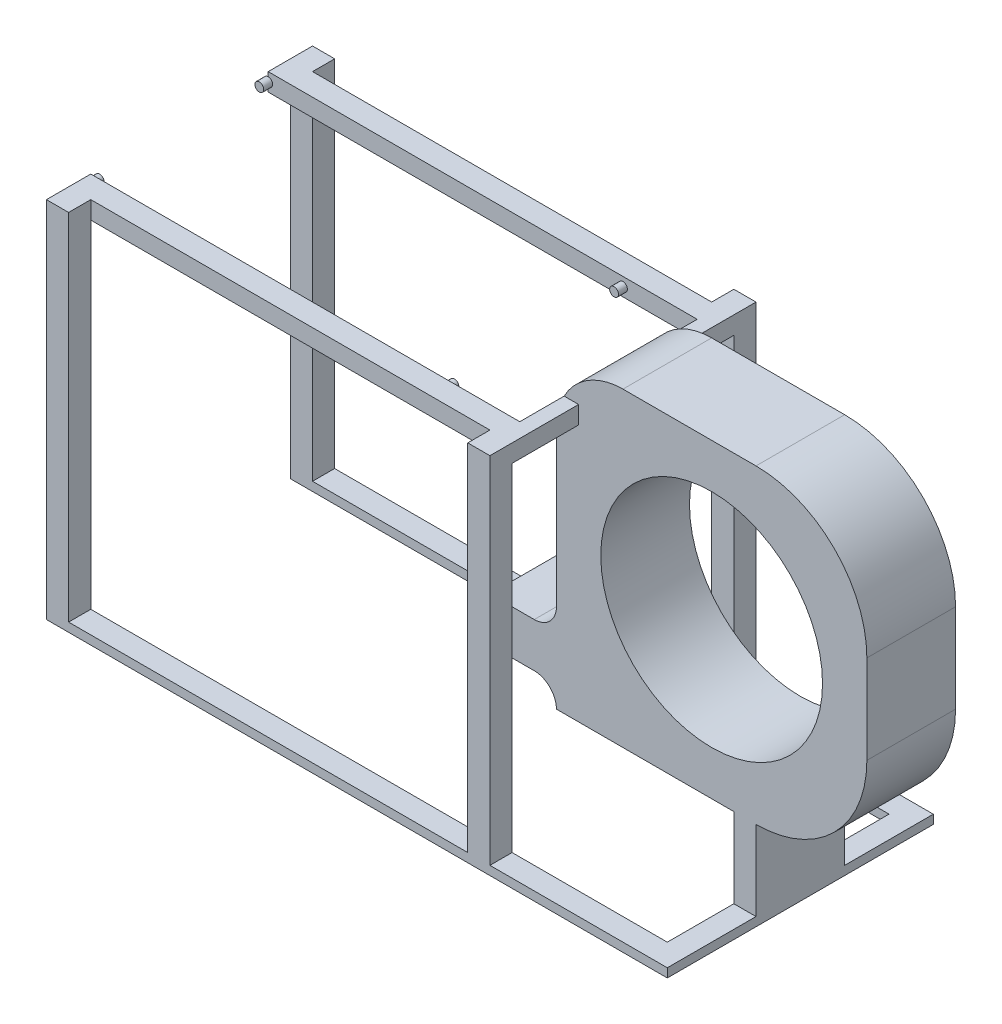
ISO-10303-21;
HEADER;
FILE_DESCRIPTION(('STEP AP214'),'2;1');
FILE_NAME('part.step','',(''),(''),'','','');
FILE_SCHEMA(('AUTOMOTIVE_DESIGN { 1 0 10303 214 1 1 1 1 }'));
ENDSEC;
DATA;
#1=APPLICATION_CONTEXT('core data for automotive mechanical design processes');
#2=APPLICATION_PROTOCOL_DEFINITION('international standard','automotive_design',2000,#1);
#3=PRODUCT_CONTEXT('',#1,'mechanical');
#4=PRODUCT('Part','Part','',(#3));
#5=PRODUCT_RELATED_PRODUCT_CATEGORY('part','',(#4));
#6=PRODUCT_DEFINITION_FORMATION('','',#4);
#7=PRODUCT_DEFINITION_CONTEXT('part definition',#1,'design');
#8=PRODUCT_DEFINITION('design','',#6,#7);
#9=PRODUCT_DEFINITION_SHAPE('','',#8);
#10=(LENGTH_UNIT() NAMED_UNIT(*) SI_UNIT(.MILLI.,.METRE.));
#11=(NAMED_UNIT(*) PLANE_ANGLE_UNIT() SI_UNIT($,.RADIAN.));
#12=(NAMED_UNIT(*) SI_UNIT($,.STERADIAN.) SOLID_ANGLE_UNIT());
#13=UNCERTAINTY_MEASURE_WITH_UNIT(LENGTH_MEASURE(1.E-05),#10,'distance_accuracy_value','');
#14=(GEOMETRIC_REPRESENTATION_CONTEXT(3) GLOBAL_UNCERTAINTY_ASSIGNED_CONTEXT((#13)) GLOBAL_UNIT_ASSIGNED_CONTEXT((#10,
#11,#12)) REPRESENTATION_CONTEXT('',''));
#15=CARTESIAN_POINT('',(0.,0.,0.));
#16=DIRECTION('',(0.,0.,1.));
#17=DIRECTION('',(1.,0.,0.));
#18=AXIS2_PLACEMENT_3D('',#15,#16,#17);
#19=CARTESIAN_POINT('',(-1300.,270.,-800.799680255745));
#20=DIRECTION('',(-1.,0.,0.));
#21=DIRECTION('',(0.,0.,1.));
#22=AXIS2_PLACEMENT_3D('',#19,#20,#21);
#23=PLANE('',#22);
#24=DIRECTION('',(0.,0.,-1.));
#25=VECTOR('',#24,1.);
#26=CARTESIAN_POINT('',(-1300.,-550.,300.));
#27=LINE('',#26,#25);
#28=CARTESIAN_POINT('',(-1300.,-550.,-250.));
#29=VERTEX_POINT('',#28);
#30=CARTESIAN_POINT('',(-1300.,-550.,-299.83088083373));
#31=VERTEX_POINT('',#30);
#32=EDGE_CURVE('E413',#29,#31,#27,.T.);
#33=ORIENTED_EDGE('',*,*,#32,.F.);
#34=DIRECTION('',(0.,1.,0.));
#35=VECTOR('',#34,1.);
#36=CARTESIAN_POINT('',(-1300.,-600.710678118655,-250.));
#37=LINE('',#36,#35);
#38=CARTESIAN_POINT('',(-1300.,230.,-250.));
#39=VERTEX_POINT('',#38);
#40=EDGE_CURVE('E445',#29,#39,#37,.T.);
#41=ORIENTED_EDGE('',*,*,#40,.T.);
#42=DIRECTION('',(0.,0.,-1.));
#43=VECTOR('',#42,1.);
#44=CARTESIAN_POINT('',(-1300.,230.,800.799680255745));
#45=LINE('',#44,#43);
#46=CARTESIAN_POINT('',(-1300.,230.,-200.));
#47=VERTEX_POINT('',#46);
#48=EDGE_CURVE('E865',#47,#39,#45,.T.);
#49=ORIENTED_EDGE('',*,*,#48,.F.);
#50=DIRECTION('',(0.,-1.,0.));
#51=VECTOR('',#50,1.);
#52=CARTESIAN_POINT('',(-1300.,230.,-200.));
#53=LINE('',#52,#51);
#54=CARTESIAN_POINT('',(-1300.,240.,-200.));
#55=VERTEX_POINT('',#54);
#56=EDGE_CURVE('E864',#55,#47,#53,.T.);
#57=ORIENTED_EDGE('',*,*,#56,.F.);
#58=CARTESIAN_POINT('',(-1300.,260.,-200.));
#59=VERTEX_POINT('',#58);
#60=EDGE_CURVE('E867',#59,#55,#53,.T.);
#61=ORIENTED_EDGE('',*,*,#60,.F.);
#62=CARTESIAN_POINT('',(-1300.,270.,-200.));
#63=VERTEX_POINT('',#62);
#64=EDGE_CURVE('E863',#63,#59,#53,.T.);
#65=ORIENTED_EDGE('',*,*,#64,.F.);
#66=DIRECTION('',(0.,0.,-1.));
#67=VECTOR('',#66,1.);
#68=CARTESIAN_POINT('',(-1300.,270.,800.799680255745));
#69=LINE('',#68,#67);
#70=CARTESIAN_POINT('',(-1300.,270.,-300.));
#71=VERTEX_POINT('',#70);
#72=EDGE_CURVE('E861',#63,#71,#69,.T.);
#73=ORIENTED_EDGE('',*,*,#72,.T.);
#74=DIRECTION('',(0.,1.,0.));
#75=VECTOR('',#74,1.);
#76=CARTESIAN_POINT('',(-1300.,-600.710678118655,-300.));
#77=LINE('',#76,#75);
#78=CARTESIAN_POINT('',(-1300.,-530.,-300.));
#79=VERTEX_POINT('',#78);
#80=EDGE_CURVE('E448',#79,#71,#77,.T.);
#81=ORIENTED_EDGE('',*,*,#80,.F.);
#82=DIRECTION('',(0.,0.,-1.));
#83=VECTOR('',#82,1.);
#84=CARTESIAN_POINT('',(-1300.,-530.,-250.));
#85=LINE('',#84,#83);
#86=CARTESIAN_POINT('',(-1300.,-530.,-299.83088083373));
#87=VERTEX_POINT('',#86);
#88=EDGE_CURVE('E643',#87,#79,#85,.T.);
#89=ORIENTED_EDGE('',*,*,#88,.F.);
#90=DIRECTION('',(0.,1.,0.));
#91=VECTOR('',#90,1.);
#92=CARTESIAN_POINT('',(-1300.,-530.,-299.83088083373));
#93=LINE('',#92,#91);
#94=EDGE_CURVE('E431',#31,#87,#93,.T.);
#95=ORIENTED_EDGE('',*,*,#94,.F.);
#96=EDGE_LOOP('',(#33,#41,#49,#57,#61,#65,#73,#81,#89,#95));
#97=FACE_BOUND('',#96,.T.);
#98=ADVANCED_FACE('F37',(#97),#23,.T.);
#99=CARTESIAN_POINT('',(-1900.16421552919,-530.,300.));
#100=DIRECTION('',(0.,1.,0.));
#101=DIRECTION('',(0.,0.,1.));
#102=AXIS2_PLACEMENT_3D('',#99,#100,#101);
#103=PLANE('',#102);
#104=DIRECTION('',(-1.,0.,0.));
#105=VECTOR('',#104,1.);
#106=CARTESIAN_POINT('',(-1300.,-530.,-250.));
#107=LINE('',#106,#105);
#108=CARTESIAN_POINT('',(-350.,-530.,-250.));
#109=VERTEX_POINT('',#108);
#110=CARTESIAN_POINT('',(-1250.,-530.,-250.));
#111=VERTEX_POINT('',#110);
#112=EDGE_CURVE('E393',#109,#111,#107,.T.);
#113=ORIENTED_EDGE('',*,*,#112,.F.);
#114=DIRECTION('',(0.,0.,-1.));
#115=VECTOR('',#114,1.);
#116=CARTESIAN_POINT('',(-350.,-530.,-250.));
#117=LINE('',#116,#115);
#118=CARTESIAN_POINT('',(-350.,-530.,-299.83088083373));
#119=VERTEX_POINT('',#118);
#120=EDGE_CURVE('E683',#109,#119,#117,.T.);
#121=ORIENTED_EDGE('',*,*,#120,.T.);
#122=DIRECTION('',(1.,0.,0.));
#123=VECTOR('',#122,1.);
#124=CARTESIAN_POINT('',(-1900.16421552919,-530.,-299.83088083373));
#125=LINE('',#124,#123);
#126=CARTESIAN_POINT('',(-1250.,-530.,-299.83088083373));
#127=VERTEX_POINT('',#126);
#128=EDGE_CURVE('E432',#127,#119,#125,.T.);
#129=ORIENTED_EDGE('',*,*,#128,.F.);
#130=DIRECTION('',(0.,0.,1.));
#131=VECTOR('',#130,1.);
#132=CARTESIAN_POINT('',(-1250.,-530.,-250.));
#133=LINE('',#132,#131);
#134=EDGE_CURVE('E830',#127,#111,#133,.T.);
#135=ORIENTED_EDGE('',*,*,#134,.T.);
#136=EDGE_LOOP('',(#113,#121,#129,#135));
#137=FACE_BOUND('',#136,.T.);
#138=ADVANCED_FACE('F979',(#137),#103,.T.);
#139=CARTESIAN_POINT('',(50.,-530.,-250.));
#140=VERTEX_POINT('',#139);
#141=CARTESIAN_POINT('',(-300.,-530.,-250.));
#142=VERTEX_POINT('',#141);
#143=EDGE_CURVE('E377',#140,#142,#107,.T.);
#144=ORIENTED_EDGE('',*,*,#143,.F.);
#145=DIRECTION('',(0.,0.,-1.));
#146=VECTOR('',#145,1.);
#147=CARTESIAN_POINT('',(50.,-530.,-250.));
#148=LINE('',#147,#146);
#149=CARTESIAN_POINT('',(50.,-530.,-100.));
#150=VERTEX_POINT('',#149);
#151=EDGE_CURVE('E394',#150,#140,#148,.T.);
#152=ORIENTED_EDGE('',*,*,#151,.F.);
#153=DIRECTION('',(1.,0.,0.));
#154=VECTOR('',#153,1.);
#155=CARTESIAN_POINT('',(100.,-530.,-100.));
#156=LINE('',#155,#154);
#157=CARTESIAN_POINT('',(100.,-530.,-100.));
#158=VERTEX_POINT('',#157);
#159=EDGE_CURVE('E438',#150,#158,#156,.T.);
#160=ORIENTED_EDGE('',*,*,#159,.T.);
#161=DIRECTION('',(0.,0.,1.));
#162=VECTOR('',#161,1.);
#163=CARTESIAN_POINT('',(100.,-530.,300.));
#164=LINE('',#163,#162);
#165=CARTESIAN_POINT('',(100.,-530.,-299.83088083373));
#166=VERTEX_POINT('',#165);
#167=EDGE_CURVE('E410',#166,#158,#164,.T.);
#168=ORIENTED_EDGE('',*,*,#167,.F.);
#169=CARTESIAN_POINT('',(-300.,-530.,-299.83088083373));
#170=VERTEX_POINT('',#169);
#171=EDGE_CURVE('E426',#170,#166,#125,.T.);
#172=ORIENTED_EDGE('',*,*,#171,.F.);
#173=DIRECTION('',(0.,0.,1.));
#174=VECTOR('',#173,1.);
#175=CARTESIAN_POINT('',(-300.,-530.,-250.));
#176=LINE('',#175,#174);
#177=EDGE_CURVE('E680',#170,#142,#176,.T.);
#178=ORIENTED_EDGE('',*,*,#177,.T.);
#179=EDGE_LOOP('',(#144,#152,#160,#168,#172,#178));
#180=FACE_BOUND('',#179,.T.);
#181=ADVANCED_FACE('F987',(#180),#103,.T.);
#182=DIRECTION('',(1.,0.,0.));
#183=VECTOR('',#182,1.);
#184=CARTESIAN_POINT('',(-1300.,-530.,250.));
#185=LINE('',#184,#183);
#186=CARTESIAN_POINT('',(-1250.,-530.,250.));
#187=VERTEX_POINT('',#186);
#188=CARTESIAN_POINT('',(-350.,-530.,250.));
#189=VERTEX_POINT('',#188);
#190=EDGE_CURVE('E387',#187,#189,#185,.T.);
#191=ORIENTED_EDGE('',*,*,#190,.F.);
#192=DIRECTION('',(0.,0.,-1.));
#193=VECTOR('',#192,1.);
#194=CARTESIAN_POINT('',(-1250.,-530.,250.));
#195=LINE('',#194,#193);
#196=CARTESIAN_POINT('',(-1250.,-530.,300.));
#197=VERTEX_POINT('',#196);
#198=EDGE_CURVE('E451',#197,#187,#195,.T.);
#199=ORIENTED_EDGE('',*,*,#198,.F.);
#200=DIRECTION('',(1.,0.,0.));
#201=VECTOR('',#200,1.);
#202=CARTESIAN_POINT('',(-1900.16421552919,-530.,300.));
#203=LINE('',#202,#201);
#204=CARTESIAN_POINT('',(-350.,-530.,300.));
#205=VERTEX_POINT('',#204);
#206=EDGE_CURVE('E418',#197,#205,#203,.T.);
#207=ORIENTED_EDGE('',*,*,#206,.T.);
#208=DIRECTION('',(0.,0.,1.));
#209=VECTOR('',#208,1.);
#210=CARTESIAN_POINT('',(-350.,-530.,250.));
#211=LINE('',#210,#209);
#212=EDGE_CURVE('E471',#189,#205,#211,.T.);
#213=ORIENTED_EDGE('',*,*,#212,.F.);
#214=EDGE_LOOP('',(#191,#199,#207,#213));
#215=FACE_BOUND('',#214,.T.);
#216=ADVANCED_FACE('F989',(#215),#103,.T.);
#217=CARTESIAN_POINT('',(-350.,-350.,-100.));
#218=DIRECTION('',(0.,-1.,0.));
#219=DIRECTION('',(0.,0.,-1.));
#220=AXIS2_PLACEMENT_3D('',#217,#218,#219);
#221=PLANE('',#220);
#222=DIRECTION('',(1.,0.,0.));
#223=VECTOR('',#222,1.);
#224=CARTESIAN_POINT('',(-350.,-350.,-100.));
#225=LINE('',#224,#223);
#226=CARTESIAN_POINT('',(-350.,-350.,-100.));
#227=VERTEX_POINT('',#226);
#228=CARTESIAN_POINT('',(50.0000000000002,-350.,-100.));
#229=VERTEX_POINT('',#228);
#230=EDGE_CURVE('E575',#227,#229,#225,.T.);
#231=ORIENTED_EDGE('',*,*,#230,.T.);
#232=DIRECTION('',(0.,0.,-1.));
#233=VECTOR('',#232,1.);
#234=CARTESIAN_POINT('',(50.0000000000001,-350.,100.));
#235=LINE('',#234,#233);
#236=CARTESIAN_POINT('',(50.0000000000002,-350.,100.));
#237=VERTEX_POINT('',#236);
#238=EDGE_CURVE('E768',#237,#229,#235,.T.);
#239=ORIENTED_EDGE('',*,*,#238,.F.);
#240=DIRECTION('',(1.,0.,0.));
#241=VECTOR('',#240,1.);
#242=CARTESIAN_POINT('',(-350.,-350.,100.));
#243=LINE('',#242,#241);
#244=CARTESIAN_POINT('',(-350.,-350.,100.));
#245=VERTEX_POINT('',#244);
#246=EDGE_CURVE('E558',#245,#237,#243,.T.);
#247=ORIENTED_EDGE('',*,*,#246,.F.);
#248=DIRECTION('',(0.,0.,1.));
#249=VECTOR('',#248,1.);
#250=CARTESIAN_POINT('',(-350.,-350.,-100.));
#251=LINE('',#250,#249);
#252=EDGE_CURVE('E582',#227,#245,#251,.T.);
#253=ORIENTED_EDGE('',*,*,#252,.F.);
#254=EDGE_LOOP('',(#231,#239,#247,#253));
#255=FACE_BOUND('',#254,.T.);
#256=ADVANCED_FACE('F766',(#255),#221,.T.);
#257=CARTESIAN_POINT('',(0.,0.,-250.));
#258=DIRECTION('',(0.,0.,-1.));
#259=DIRECTION('',(-1.,0.,0.));
#260=AXIS2_PLACEMENT_3D('',#257,#258,#259);
#261=PLANE('',#260);
#262=DIRECTION('',(-1.,0.,0.));
#263=VECTOR('',#262,1.);
#264=CARTESIAN_POINT('',(-300.,230.,-250.));
#265=LINE('',#264,#263);
#266=CARTESIAN_POINT('',(-350.,230.,-250.));
#267=VERTEX_POINT('',#266);
#268=CARTESIAN_POINT('',(-1250.,229.999999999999,-250.));
#269=VERTEX_POINT('',#268);
#270=EDGE_CURVE('E619',#267,#269,#265,.T.);
#271=ORIENTED_EDGE('',*,*,#270,.T.);
#272=DIRECTION('',(0.,1.,0.));
#273=VECTOR('',#272,1.);
#274=CARTESIAN_POINT('',(-1250.,-600.710678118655,-250.));
#275=LINE('',#274,#273);
#276=CARTESIAN_POINT('',(-1250.,270.,-250.));
#277=VERTEX_POINT('',#276);
#278=EDGE_CURVE('E661',#269,#277,#275,.T.);
#279=ORIENTED_EDGE('',*,*,#278,.T.);
#280=DIRECTION('',(1.,0.,0.));
#281=VECTOR('',#280,1.);
#282=CARTESIAN_POINT('',(-350.,270.,-250.));
#283=LINE('',#282,#281);
#284=CARTESIAN_POINT('',(-350.,270.,-250.));
#285=VERTEX_POINT('',#284);
#286=EDGE_CURVE('E626',#277,#285,#283,.T.);
#287=ORIENTED_EDGE('',*,*,#286,.T.);
#288=DIRECTION('',(0.,1.,0.));
#289=VECTOR('',#288,1.);
#290=CARTESIAN_POINT('',(-350.,-530.,-250.));
#291=LINE('',#290,#289);
#292=EDGE_CURVE('E509',#267,#285,#291,.T.);
#293=ORIENTED_EDGE('',*,*,#292,.F.);
#294=EDGE_LOOP('',(#271,#279,#287,#293));
#295=FACE_BOUND('',#294,.T.);
#296=ADVANCED_FACE('F973',(#295),#261,.T.);
#297=CARTESIAN_POINT('',(0.,0.,250.));
#298=DIRECTION('',(0.,0.,1.));
#299=DIRECTION('',(1.,0.,0.));
#300=AXIS2_PLACEMENT_3D('',#297,#298,#299);
#301=PLANE('',#300);
#302=DIRECTION('',(0.,1.,0.));
#303=VECTOR('',#302,1.);
#304=CARTESIAN_POINT('',(-1250.,-600.710678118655,250.));
#305=LINE('',#304,#303);
#306=CARTESIAN_POINT('',(-1250.,229.999999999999,250.));
#307=VERTEX_POINT('',#306);
#308=CARTESIAN_POINT('',(-1250.,270.,250.));
#309=VERTEX_POINT('',#308);
#310=EDGE_CURVE('E454',#307,#309,#305,.T.);
#311=ORIENTED_EDGE('',*,*,#310,.F.);
#312=DIRECTION('',(1.,0.,0.));
#313=VECTOR('',#312,1.);
#314=CARTESIAN_POINT('',(-300.,230.,250.));
#315=LINE('',#314,#313);
#316=CARTESIAN_POINT('',(-350.,230.,250.));
#317=VERTEX_POINT('',#316);
#318=EDGE_CURVE('E521',#307,#317,#315,.T.);
#319=ORIENTED_EDGE('',*,*,#318,.T.);
#320=DIRECTION('',(0.,1.,0.));
#321=VECTOR('',#320,1.);
#322=CARTESIAN_POINT('',(-350.,-530.,250.));
#323=LINE('',#322,#321);
#324=CARTESIAN_POINT('',(-350.,270.,250.));
#325=VERTEX_POINT('',#324);
#326=EDGE_CURVE('E505',#317,#325,#323,.T.);
#327=ORIENTED_EDGE('',*,*,#326,.T.);
#328=DIRECTION('',(-1.,0.,0.));
#329=VECTOR('',#328,1.);
#330=CARTESIAN_POINT('',(-300.,270.,250.));
#331=LINE('',#330,#329);
#332=EDGE_CURVE('E511',#325,#309,#331,.T.);
#333=ORIENTED_EDGE('',*,*,#332,.T.);
#334=EDGE_LOOP('',(#311,#319,#327,#333));
#335=FACE_BOUND('',#334,.T.);
#336=ADVANCED_FACE('F904',(#335),#301,.T.);
#337=CARTESIAN_POINT('',(0.,0.,-200.));
#338=DIRECTION('',(0.,0.,-1.));
#339=DIRECTION('',(-1.,0.,0.));
#340=AXIS2_PLACEMENT_3D('',#337,#338,#339);
#341=PLANE('',#340);
#342=CARTESIAN_POINT('',(-1300.,250.,-200.));
#343=DIRECTION('',(0.,0.,-1.));
#344=DIRECTION('',(-1.,0.,0.));
#345=AXIS2_PLACEMENT_3D('',#342,#343,#344);
#346=CIRCLE('',#345,10.0000000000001);
#347=EDGE_CURVE('E584',#55,#59,#346,.F.);
#348=ORIENTED_EDGE('',*,*,#347,.F.);
#349=ORIENTED_EDGE('',*,*,#56,.T.);
#350=DIRECTION('',(1.,0.,0.));
#351=VECTOR('',#350,1.);
#352=CARTESIAN_POINT('',(-300.,230.,-200.));
#353=LINE('',#352,#351);
#354=CARTESIAN_POINT('',(-346.969384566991,230.,-200.));
#355=VERTEX_POINT('',#354);
#356=EDGE_CURVE('E874',#47,#355,#353,.T.);
#357=ORIENTED_EDGE('',*,*,#356,.T.);
#358=CARTESIAN_POINT('',(-200.,200.,-200.));
#359=DIRECTION('',(0.,0.,-1.));
#360=DIRECTION('',(-1.,0.,0.));
#361=AXIS2_PLACEMENT_3D('',#358,#359,#360);
#362=CIRCLE('',#361,150.);
#363=CARTESIAN_POINT('',(-332.664991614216,270.,-200.));
#364=VERTEX_POINT('',#363);
#365=EDGE_CURVE('E747',#355,#364,#362,.T.);
#366=ORIENTED_EDGE('',*,*,#365,.T.);
#367=DIRECTION('',(-1.,0.,0.));
#368=VECTOR('',#367,1.);
#369=CARTESIAN_POINT('',(-1300.,270.,-200.));
#370=LINE('',#369,#368);
#371=EDGE_CURVE('E872',#364,#63,#370,.T.);
#372=ORIENTED_EDGE('',*,*,#371,.T.);
#373=ORIENTED_EDGE('',*,*,#64,.T.);
#374=EDGE_LOOP('',(#348,#349,#357,#366,#372,#373));
#375=FACE_BOUND('',#374,.T.);
#376=CARTESIAN_POINT('',(-500.,250.,-200.));
#377=DIRECTION('',(0.,0.,-1.));
#378=DIRECTION('',(-1.,0.,0.));
#379=AXIS2_PLACEMENT_3D('',#376,#377,#378);
#380=CIRCLE('',#379,9.99999999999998);
#381=CARTESIAN_POINT('',(-510.,250.,-200.));
#382=VERTEX_POINT('',#381);
#383=EDGE_CURVE('E787',#382,#382,#380,.F.);
#384=ORIENTED_EDGE('',*,*,#383,.F.);
#385=EDGE_LOOP('',(#384));
#386=FACE_BOUND('',#385,.T.);
#387=ADVANCED_FACE('F1031',(#375,#386),#341,.F.);
#388=CARTESIAN_POINT('',(-500.,0.,0.));
#389=DIRECTION('',(1.,0.,0.));
#390=DIRECTION('',(0.,0.,-1.));
#391=AXIS2_PLACEMENT_3D('',#388,#389,#390);
#392=PLANE('',#391);
#393=DIRECTION('',(0.,1.,0.));
#394=VECTOR('',#393,1.);
#395=CARTESIAN_POINT('',(-500.,-300.,-100.));
#396=LINE('',#395,#394);
#397=CARTESIAN_POINT('',(-500.,-240.,-100.));
#398=VERTEX_POINT('',#397);
#399=CARTESIAN_POINT('',(-500.,-200.,-100.));
#400=VERTEX_POINT('',#399);
#401=EDGE_CURVE('E542',#398,#400,#396,.T.);
#402=ORIENTED_EDGE('',*,*,#401,.F.);
#403=DIRECTION('',(0.,0.,1.));
#404=VECTOR('',#403,1.);
#405=CARTESIAN_POINT('',(-500.,-240.,-140.));
#406=LINE('',#405,#404);
#407=CARTESIAN_POINT('',(-500.,-240.,100.));
#408=VERTEX_POINT('',#407);
#409=EDGE_CURVE('E785',#398,#408,#406,.T.);
#410=ORIENTED_EDGE('',*,*,#409,.T.);
#411=DIRECTION('',(0.,-1.,0.));
#412=VECTOR('',#411,1.);
#413=CARTESIAN_POINT('',(-500.,-300.,100.));
#414=LINE('',#413,#412);
#415=CARTESIAN_POINT('',(-500.,-200.,100.));
#416=VERTEX_POINT('',#415);
#417=EDGE_CURVE('E535',#416,#408,#414,.T.);
#418=ORIENTED_EDGE('',*,*,#417,.F.);
#419=DIRECTION('',(0.,0.,1.));
#420=VECTOR('',#419,1.);
#421=CARTESIAN_POINT('',(-500.,-200.,-100.));
#422=LINE('',#421,#420);
#423=EDGE_CURVE('E547',#400,#416,#422,.T.);
#424=ORIENTED_EDGE('',*,*,#423,.F.);
#425=EDGE_LOOP('',(#402,#410,#418,#424));
#426=FACE_BOUND('',#425,.T.);
#427=ADVANCED_FACE('F1034',(#426),#392,.F.);
#428=CARTESIAN_POINT('',(0.,0.,200.));
#429=DIRECTION('',(0.,0.,1.));
#430=DIRECTION('',(1.,0.,0.));
#431=AXIS2_PLACEMENT_3D('',#428,#429,#430);
#432=PLANE('',#431);
#433=CARTESIAN_POINT('',(-500.,250.,200.));
#434=DIRECTION('',(0.,0.,1.));
#435=DIRECTION('',(1.,0.,0.));
#436=AXIS2_PLACEMENT_3D('',#433,#434,#435);
#437=CIRCLE('',#436,9.99999999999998);
#438=CARTESIAN_POINT('',(-490.,250.,200.));
#439=VERTEX_POINT('',#438);
#440=EDGE_CURVE('E478',#439,#439,#437,.T.);
#441=ORIENTED_EDGE('',*,*,#440,.T.);
#442=EDGE_LOOP('',(#441));
#443=FACE_BOUND('',#442,.T.);
#444=CARTESIAN_POINT('',(-1300.,250.,200.));
#445=DIRECTION('',(0.,0.,-1.));
#446=DIRECTION('',(-1.,0.,0.));
#447=AXIS2_PLACEMENT_3D('',#444,#445,#446);
#448=CIRCLE('',#447,10.0000000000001);
#449=CARTESIAN_POINT('',(-1300.,260.,200.));
#450=VERTEX_POINT('',#449);
#451=CARTESIAN_POINT('',(-1300.,240.,200.));
#452=VERTEX_POINT('',#451);
#453=EDGE_CURVE('E1092',#450,#452,#448,.T.);
#454=ORIENTED_EDGE('',*,*,#453,.F.);
#455=DIRECTION('',(0.,1.,0.));
#456=VECTOR('',#455,1.);
#457=CARTESIAN_POINT('',(-1300.,270.,200.));
#458=LINE('',#457,#456);
#459=CARTESIAN_POINT('',(-1300.,270.,200.));
#460=VERTEX_POINT('',#459);
#461=EDGE_CURVE('E877',#450,#460,#458,.T.);
#462=ORIENTED_EDGE('',*,*,#461,.T.);
#463=DIRECTION('',(1.,0.,0.));
#464=VECTOR('',#463,1.);
#465=CARTESIAN_POINT('',(-300.,270.,200.));
#466=LINE('',#465,#464);
#467=CARTESIAN_POINT('',(-332.664991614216,270.,200.));
#468=VERTEX_POINT('',#467);
#469=EDGE_CURVE('E717',#460,#468,#466,.T.);
#470=ORIENTED_EDGE('',*,*,#469,.T.);
#471=CARTESIAN_POINT('',(-200.,200.,200.));
#472=DIRECTION('',(0.,0.,1.));
#473=DIRECTION('',(1.,0.,0.));
#474=AXIS2_PLACEMENT_3D('',#471,#472,#473);
#475=CIRCLE('',#474,150.);
#476=CARTESIAN_POINT('',(-346.969384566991,230.,200.));
#477=VERTEX_POINT('',#476);
#478=EDGE_CURVE('E745',#468,#477,#475,.T.);
#479=ORIENTED_EDGE('',*,*,#478,.T.);
#480=DIRECTION('',(-1.,0.,0.));
#481=VECTOR('',#480,1.);
#482=CARTESIAN_POINT('',(-300.,230.,200.));
#483=LINE('',#482,#481);
#484=CARTESIAN_POINT('',(-1300.,230.,200.));
#485=VERTEX_POINT('',#484);
#486=EDGE_CURVE('E718',#477,#485,#483,.T.);
#487=ORIENTED_EDGE('',*,*,#486,.T.);
#488=EDGE_CURVE('E724',#485,#452,#458,.T.);
#489=ORIENTED_EDGE('',*,*,#488,.T.);
#490=EDGE_LOOP('',(#454,#462,#470,#479,#487,#489));
#491=FACE_BOUND('',#490,.T.);
#492=ADVANCED_FACE('F1052',(#443,#491),#432,.F.);
#493=CARTESIAN_POINT('',(-350.,350.,-100.));
#494=DIRECTION('',(-1.,0.,0.));
#495=DIRECTION('',(0.,-1.,0.));
#496=AXIS2_PLACEMENT_3D('',#493,#494,#495);
#497=PLANE('',#496);
#498=DIRECTION('',(0.,-1.,0.));
#499=VECTOR('',#498,1.);
#500=CARTESIAN_POINT('',(-350.,350.,-100.));
#501=LINE('',#500,#499);
#502=CARTESIAN_POINT('',(-350.,200.,-100.));
#503=VERTEX_POINT('',#502);
#504=CARTESIAN_POINT('',(-350.,-150.,-100.));
#505=VERTEX_POINT('',#504);
#506=EDGE_CURVE('E571',#503,#505,#501,.T.);
#507=ORIENTED_EDGE('',*,*,#506,.T.);
#508=DIRECTION('',(0.,0.,-1.));
#509=VECTOR('',#508,1.);
#510=CARTESIAN_POINT('',(-350.,-150.,-99.9999999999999));
#511=LINE('',#510,#509);
#512=CARTESIAN_POINT('',(-350.,-150.,100.));
#513=VERTEX_POINT('',#512);
#514=EDGE_CURVE('E753',#505,#513,#511,.F.);
#515=ORIENTED_EDGE('',*,*,#514,.T.);
#516=DIRECTION('',(0.,-1.,0.));
#517=VECTOR('',#516,1.);
#518=CARTESIAN_POINT('',(-350.,350.,100.));
#519=LINE('',#518,#517);
#520=CARTESIAN_POINT('',(-350.,200.,100.));
#521=VERTEX_POINT('',#520);
#522=EDGE_CURVE('E555',#521,#513,#519,.T.);
#523=ORIENTED_EDGE('',*,*,#522,.F.);
#524=DIRECTION('',(0.,0.,1.));
#525=VECTOR('',#524,1.);
#526=CARTESIAN_POINT('',(-350.,200.,-100.));
#527=LINE('',#526,#525);
#528=EDGE_CURVE('E570',#521,#503,#527,.F.);
#529=ORIENTED_EDGE('',*,*,#528,.T.);
#530=EDGE_LOOP('',(#507,#515,#523,#529));
#531=FACE_BOUND('',#530,.T.);
#532=ADVANCED_FACE('F1046',(#531),#497,.T.);
#533=CARTESIAN_POINT('',(0.,0.,-100.));
#534=DIRECTION('',(0.,0.,1.));
#535=DIRECTION('',(1.,0.,0.));
#536=AXIS2_PLACEMENT_3D('',#533,#534,#535);
#537=PLANE('',#536);
#538=CARTESIAN_POINT('',(0.,0.,-100.));
#539=DIRECTION('',(0.,0.,1.));
#540=DIRECTION('',(1.,0.,0.));
#541=AXIS2_PLACEMENT_3D('',#538,#539,#540);
#542=CIRCLE('',#541,250.);
#543=CARTESIAN_POINT('',(250.,0.,-100.));
#544=VERTEX_POINT('',#543);
#545=EDGE_CURVE('E1159',#544,#544,#542,.F.);
#546=ORIENTED_EDGE('',*,*,#545,.F.);
#547=EDGE_LOOP('',(#546));
#548=FACE_BOUND('',#547,.T.);
#549=ORIENTED_EDGE('',*,*,#506,.F.);
#550=CARTESIAN_POINT('',(-200.,200.,-100.));
#551=DIRECTION('',(0.,0.,1.));
#552=DIRECTION('',(1.,0.,0.));
#553=AXIS2_PLACEMENT_3D('',#550,#551,#552);
#554=CIRCLE('',#553,150.);
#555=CARTESIAN_POINT('',(-346.969384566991,230.,-100.));
#556=VERTEX_POINT('',#555);
#557=EDGE_CURVE('E743',#503,#556,#554,.F.);
#558=ORIENTED_EDGE('',*,*,#557,.T.);
#559=DIRECTION('',(-1.,0.,0.));
#560=VECTOR('',#559,1.);
#561=CARTESIAN_POINT('',(-300.,230.,-100.));
#562=LINE('',#561,#560);
#563=CARTESIAN_POINT('',(-300.,230.,-100.));
#564=VERTEX_POINT('',#563);
#565=EDGE_CURVE('E730',#564,#556,#562,.T.);
#566=ORIENTED_EDGE('',*,*,#565,.F.);
#567=DIRECTION('',(0.,-1.,0.));
#568=VECTOR('',#567,1.);
#569=CARTESIAN_POINT('',(-300.,270.,-100.));
#570=LINE('',#569,#568);
#571=CARTESIAN_POINT('',(-300.,270.,-100.));
#572=VERTEX_POINT('',#571);
#573=EDGE_CURVE('E636',#572,#564,#570,.T.);
#574=ORIENTED_EDGE('',*,*,#573,.F.);
#575=DIRECTION('',(1.,0.,0.));
#576=VECTOR('',#575,1.);
#577=CARTESIAN_POINT('',(-350.,270.,-100.));
#578=LINE('',#577,#576);
#579=CARTESIAN_POINT('',(-332.664991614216,270.,-100.));
#580=VERTEX_POINT('',#579);
#581=EDGE_CURVE('E641',#580,#572,#578,.T.);
#582=ORIENTED_EDGE('',*,*,#581,.F.);
#583=CARTESIAN_POINT('',(-200.,200.,-100.));
#584=DIRECTION('',(0.,0.,1.));
#585=DIRECTION('',(1.,0.,0.));
#586=AXIS2_PLACEMENT_3D('',#583,#584,#585);
#587=CIRCLE('',#586,150.);
#588=CARTESIAN_POINT('',(-200.,350.,-100.));
#589=VERTEX_POINT('',#588);
#590=EDGE_CURVE('E741',#580,#589,#587,.F.);
#591=ORIENTED_EDGE('',*,*,#590,.T.);
#592=DIRECTION('',(-1.,0.,0.));
#593=VECTOR('',#592,1.);
#594=CARTESIAN_POINT('',(-350.,350.,-100.));
#595=LINE('',#594,#593);
#596=CARTESIAN_POINT('',(100.,350.,-100.));
#597=VERTEX_POINT('',#596);
#598=EDGE_CURVE('E576',#597,#589,#595,.T.);
#599=ORIENTED_EDGE('',*,*,#598,.F.);
#600=CARTESIAN_POINT('',(100.,100.,-100.));
#601=DIRECTION('',(0.,0.,1.));
#602=DIRECTION('',(1.,0.,0.));
#603=AXIS2_PLACEMENT_3D('',#600,#601,#602);
#604=CIRCLE('',#603,250.);
#605=CARTESIAN_POINT('',(350.,100.,-100.));
#606=VERTEX_POINT('',#605);
#607=EDGE_CURVE('E800',#597,#606,#604,.F.);
#608=ORIENTED_EDGE('',*,*,#607,.T.);
#609=DIRECTION('',(0.,1.,0.));
#610=VECTOR('',#609,1.);
#611=CARTESIAN_POINT('',(350.,350.,-100.));
#612=LINE('',#611,#610);
#613=CARTESIAN_POINT('',(350.,-99.9999999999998,-100.));
#614=VERTEX_POINT('',#613);
#615=EDGE_CURVE('E769',#614,#606,#612,.T.);
#616=ORIENTED_EDGE('',*,*,#615,.F.);
#617=CARTESIAN_POINT('',(100.,-99.9999999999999,-100.));
#618=DIRECTION('',(0.,0.,1.));
#619=DIRECTION('',(1.,0.,0.));
#620=AXIS2_PLACEMENT_3D('',#617,#618,#619);
#621=CIRCLE('',#620,250.);
#622=CARTESIAN_POINT('',(100.,-350.,-100.));
#623=VERTEX_POINT('',#622);
#624=EDGE_CURVE('E510',#614,#623,#621,.F.);
#625=ORIENTED_EDGE('',*,*,#624,.T.);
#626=DIRECTION('',(0.,1.,0.));
#627=VECTOR('',#626,1.);
#628=CARTESIAN_POINT('',(100.,-736.155281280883,-100.));
#629=LINE('',#628,#627);
#630=EDGE_CURVE('E814',#158,#623,#629,.T.);
#631=ORIENTED_EDGE('',*,*,#630,.F.);
#632=ORIENTED_EDGE('',*,*,#159,.F.);
#633=DIRECTION('',(0.,1.,0.));
#634=VECTOR('',#633,1.);
#635=CARTESIAN_POINT('',(50.0000000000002,-736.155281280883,-100.));
#636=LINE('',#635,#634);
#637=EDGE_CURVE('E963',#150,#229,#636,.T.);
#638=ORIENTED_EDGE('',*,*,#637,.T.);
#639=ORIENTED_EDGE('',*,*,#230,.F.);
#640=CARTESIAN_POINT('',(-400.,-350.,-100.));
#641=DIRECTION('',(0.,0.,1.));
#642=DIRECTION('',(1.,0.,0.));
#643=AXIS2_PLACEMENT_3D('',#640,#641,#642);
#644=CIRCLE('',#643,50.);
#645=CARTESIAN_POINT('',(-400.,-300.,-100.));
#646=VERTEX_POINT('',#645);
#647=EDGE_CURVE('E11',#227,#646,#644,.T.);
#648=ORIENTED_EDGE('',*,*,#647,.T.);
#649=DIRECTION('',(1.,0.,0.));
#650=VECTOR('',#649,1.);
#651=CARTESIAN_POINT('',(-723.606797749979,-300.,-100.));
#652=LINE('',#651,#650);
#653=CARTESIAN_POINT('',(-500.,-300.,-100.));
#654=VERTEX_POINT('',#653);
#655=EDGE_CURVE('E550',#654,#646,#652,.T.);
#656=ORIENTED_EDGE('',*,*,#655,.F.);
#657=CARTESIAN_POINT('',(-500.,-260.,-100.));
#658=VERTEX_POINT('',#657);
#659=EDGE_CURVE('E543',#654,#658,#396,.T.);
#660=ORIENTED_EDGE('',*,*,#659,.T.);
#661=CARTESIAN_POINT('',(-500.,-250.,-100.));
#662=DIRECTION('',(0.,0.,1.));
#663=DIRECTION('',(1.,0.,0.));
#664=AXIS2_PLACEMENT_3D('',#661,#662,#663);
#665=CIRCLE('',#664,9.99999999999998);
#666=EDGE_CURVE('E776',#658,#398,#665,.T.);
#667=ORIENTED_EDGE('',*,*,#666,.T.);
#668=ORIENTED_EDGE('',*,*,#401,.T.);
#669=DIRECTION('',(1.,0.,0.));
#670=VECTOR('',#669,1.);
#671=CARTESIAN_POINT('',(-723.606797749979,-200.,-100.));
#672=LINE('',#671,#670);
#673=CARTESIAN_POINT('',(-400.,-200.,-100.));
#674=VERTEX_POINT('',#673);
#675=EDGE_CURVE('E594',#400,#674,#672,.T.);
#676=ORIENTED_EDGE('',*,*,#675,.T.);
#677=CARTESIAN_POINT('',(-400.,-150.,-100.));
#678=DIRECTION('',(0.,0.,1.));
#679=DIRECTION('',(1.,0.,0.));
#680=AXIS2_PLACEMENT_3D('',#677,#678,#679);
#681=CIRCLE('',#680,50.);
#682=EDGE_CURVE('E755',#674,#505,#681,.T.);
#683=ORIENTED_EDGE('',*,*,#682,.T.);
#684=EDGE_LOOP('',(#549,#558,#566,#574,#582,#591,#599,#608,#616,#625,#631,#632,#638,#639,#648,
#656,#660,#667,#668,#676,#683));
#685=FACE_BOUND('',#684,.T.);
#686=ADVANCED_FACE('F774',(#548,#685),#537,.F.);
#687=CARTESIAN_POINT('',(350.,350.,-100.));
#688=DIRECTION('',(1.,0.,0.));
#689=DIRECTION('',(0.,1.,0.));
#690=AXIS2_PLACEMENT_3D('',#687,#688,#689);
#691=PLANE('',#690);
#692=DIRECTION('',(0.,1.,0.));
#693=VECTOR('',#692,1.);
#694=CARTESIAN_POINT('',(350.,350.,100.));
#695=LINE('',#694,#693);
#696=CARTESIAN_POINT('',(350.,-99.9999999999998,100.));
#697=VERTEX_POINT('',#696);
#698=CARTESIAN_POINT('',(350.,100.,100.));
#699=VERTEX_POINT('',#698);
#700=EDGE_CURVE('E546',#697,#699,#695,.T.);
#701=ORIENTED_EDGE('',*,*,#700,.F.);
#702=DIRECTION('',(0.,0.,1.));
#703=VECTOR('',#702,1.);
#704=CARTESIAN_POINT('',(350.,-99.9999999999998,-100.));
#705=LINE('',#704,#703);
#706=EDGE_CURVE('E808',#697,#614,#705,.F.);
#707=ORIENTED_EDGE('',*,*,#706,.T.);
#708=ORIENTED_EDGE('',*,*,#615,.T.);
#709=DIRECTION('',(0.,0.,1.));
#710=VECTOR('',#709,1.);
#711=CARTESIAN_POINT('',(350.,100.,-100.));
#712=LINE('',#711,#710);
#713=EDGE_CURVE('E793',#606,#699,#712,.T.);
#714=ORIENTED_EDGE('',*,*,#713,.T.);
#715=EDGE_LOOP('',(#701,#707,#708,#714));
#716=FACE_BOUND('',#715,.T.);
#717=ADVANCED_FACE('F958',(#716),#691,.T.);
#718=CARTESIAN_POINT('',(-350.,350.,-100.));
#719=DIRECTION('',(0.,1.,0.));
#720=DIRECTION('',(0.,0.,1.));
#721=AXIS2_PLACEMENT_3D('',#718,#719,#720);
#722=PLANE('',#721);
#723=ORIENTED_EDGE('',*,*,#598,.T.);
#724=DIRECTION('',(0.,0.,1.));
#725=VECTOR('',#724,1.);
#726=CARTESIAN_POINT('',(-200.,350.,-100.));
#727=LINE('',#726,#725);
#728=CARTESIAN_POINT('',(-200.,350.,100.));
#729=VERTEX_POINT('',#728);
#730=EDGE_CURVE('E921',#589,#729,#727,.T.);
#731=ORIENTED_EDGE('',*,*,#730,.T.);
#732=DIRECTION('',(-1.,0.,0.));
#733=VECTOR('',#732,1.);
#734=CARTESIAN_POINT('',(-350.,350.,100.));
#735=LINE('',#734,#733);
#736=CARTESIAN_POINT('',(100.,350.,100.));
#737=VERTEX_POINT('',#736);
#738=EDGE_CURVE('E552',#737,#729,#735,.T.);
#739=ORIENTED_EDGE('',*,*,#738,.F.);
#740=DIRECTION('',(0.,0.,1.));
#741=VECTOR('',#740,1.);
#742=CARTESIAN_POINT('',(100.,350.,-100.));
#743=LINE('',#742,#741);
#744=EDGE_CURVE('E798',#737,#597,#743,.F.);
#745=ORIENTED_EDGE('',*,*,#744,.T.);
#746=EDGE_LOOP('',(#723,#731,#739,#745));
#747=FACE_BOUND('',#746,.T.);
#748=ADVANCED_FACE('F952',(#747),#722,.T.);
#749=CARTESIAN_POINT('',(0.,0.,100.));
#750=DIRECTION('',(0.,0.,1.));
#751=DIRECTION('',(1.,0.,0.));
#752=AXIS2_PLACEMENT_3D('',#749,#750,#751);
#753=PLANE('',#752);
#754=CARTESIAN_POINT('',(0.,0.,100.));
#755=DIRECTION('',(0.,0.,1.));
#756=DIRECTION('',(1.,0.,0.));
#757=AXIS2_PLACEMENT_3D('',#754,#755,#756);
#758=CIRCLE('',#757,250.);
#759=CARTESIAN_POINT('',(250.,0.,100.));
#760=VERTEX_POINT('',#759);
#761=EDGE_CURVE('E1156',#760,#760,#758,.T.);
#762=ORIENTED_EDGE('',*,*,#761,.F.);
#763=EDGE_LOOP('',(#762));
#764=FACE_BOUND('',#763,.T.);
#765=ORIENTED_EDGE('',*,*,#738,.T.);
#766=CARTESIAN_POINT('',(-200.,200.,100.));
#767=DIRECTION('',(0.,0.,1.));
#768=DIRECTION('',(1.,0.,0.));
#769=AXIS2_PLACEMENT_3D('',#766,#767,#768);
#770=CIRCLE('',#769,150.);
#771=CARTESIAN_POINT('',(-332.664991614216,270.,100.));
#772=VERTEX_POINT('',#771);
#773=EDGE_CURVE('E568',#729,#772,#770,.T.);
#774=ORIENTED_EDGE('',*,*,#773,.T.);
#775=DIRECTION('',(-1.,0.,0.));
#776=VECTOR('',#775,1.);
#777=CARTESIAN_POINT('',(-300.,270.,100.));
#778=LINE('',#777,#776);
#779=CARTESIAN_POINT('',(-300.,270.,100.));
#780=VERTEX_POINT('',#779);
#781=EDGE_CURVE('E533',#780,#772,#778,.T.);
#782=ORIENTED_EDGE('',*,*,#781,.F.);
#783=DIRECTION('',(0.,1.,0.));
#784=VECTOR('',#783,1.);
#785=CARTESIAN_POINT('',(-300.,270.,100.));
#786=LINE('',#785,#784);
#787=CARTESIAN_POINT('',(-300.,230.,100.));
#788=VERTEX_POINT('',#787);
#789=EDGE_CURVE('E534',#788,#780,#786,.T.);
#790=ORIENTED_EDGE('',*,*,#789,.F.);
#791=DIRECTION('',(1.,0.,0.));
#792=VECTOR('',#791,1.);
#793=CARTESIAN_POINT('',(-300.,230.,100.));
#794=LINE('',#793,#792);
#795=CARTESIAN_POINT('',(-346.969384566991,230.,100.));
#796=VERTEX_POINT('',#795);
#797=EDGE_CURVE('E522',#796,#788,#794,.T.);
#798=ORIENTED_EDGE('',*,*,#797,.F.);
#799=CARTESIAN_POINT('',(-200.,200.,100.));
#800=DIRECTION('',(0.,0.,1.));
#801=DIRECTION('',(1.,0.,0.));
#802=AXIS2_PLACEMENT_3D('',#799,#800,#801);
#803=CIRCLE('',#802,150.);
#804=EDGE_CURVE('E566',#796,#521,#803,.T.);
#805=ORIENTED_EDGE('',*,*,#804,.T.);
#806=ORIENTED_EDGE('',*,*,#522,.T.);
#807=CARTESIAN_POINT('',(-400.,-150.,100.));
#808=DIRECTION('',(0.,0.,1.));
#809=DIRECTION('',(1.,0.,0.));
#810=AXIS2_PLACEMENT_3D('',#807,#808,#809);
#811=CIRCLE('',#810,50.);
#812=CARTESIAN_POINT('',(-400.,-200.,100.));
#813=VERTEX_POINT('',#812);
#814=EDGE_CURVE('E757',#513,#813,#811,.F.);
#815=ORIENTED_EDGE('',*,*,#814,.T.);
#816=DIRECTION('',(1.,0.,0.));
#817=VECTOR('',#816,1.);
#818=CARTESIAN_POINT('',(-723.606797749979,-200.,100.));
#819=LINE('',#818,#817);
#820=EDGE_CURVE('E588',#416,#813,#819,.T.);
#821=ORIENTED_EDGE('',*,*,#820,.F.);
#822=ORIENTED_EDGE('',*,*,#417,.T.);
#823=CARTESIAN_POINT('',(-500.,-250.,100.));
#824=DIRECTION('',(0.,0.,1.));
#825=DIRECTION('',(1.,0.,0.));
#826=AXIS2_PLACEMENT_3D('',#823,#824,#825);
#827=CIRCLE('',#826,9.99999999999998);
#828=CARTESIAN_POINT('',(-500.,-260.,100.));
#829=VERTEX_POINT('',#828);
#830=EDGE_CURVE('E1078',#829,#408,#827,.T.);
#831=ORIENTED_EDGE('',*,*,#830,.F.);
#832=CARTESIAN_POINT('',(-500.,-300.,100.));
#833=VERTEX_POINT('',#832);
#834=EDGE_CURVE('E539',#829,#833,#414,.T.);
#835=ORIENTED_EDGE('',*,*,#834,.T.);
#836=DIRECTION('',(1.,0.,0.));
#837=VECTOR('',#836,1.);
#838=CARTESIAN_POINT('',(-723.606797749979,-300.,100.));
#839=LINE('',#838,#837);
#840=CARTESIAN_POINT('',(-400.,-300.,100.));
#841=VERTEX_POINT('',#840);
#842=EDGE_CURVE('E585',#833,#841,#839,.T.);
#843=ORIENTED_EDGE('',*,*,#842,.T.);
#844=CARTESIAN_POINT('',(-400.,-350.,100.));
#845=DIRECTION('',(0.,0.,1.));
#846=DIRECTION('',(1.,0.,0.));
#847=AXIS2_PLACEMENT_3D('',#844,#845,#846);
#848=CIRCLE('',#847,50.);
#849=EDGE_CURVE('E45',#841,#245,#848,.F.);
#850=ORIENTED_EDGE('',*,*,#849,.T.);
#851=ORIENTED_EDGE('',*,*,#246,.T.);
#852=DIRECTION('',(0.,1.,0.));
#853=VECTOR('',#852,1.);
#854=CARTESIAN_POINT('',(50.0000000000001,-736.155281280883,100.));
#855=LINE('',#854,#853);
#856=CARTESIAN_POINT('',(50.,-530.,100.));
#857=VERTEX_POINT('',#856);
#858=EDGE_CURVE('E827',#857,#237,#855,.T.);
#859=ORIENTED_EDGE('',*,*,#858,.F.);
#860=DIRECTION('',(-1.,0.,0.));
#861=VECTOR('',#860,1.);
#862=CARTESIAN_POINT('',(100.,-530.,100.));
#863=LINE('',#862,#861);
#864=CARTESIAN_POINT('',(100.,-530.,100.));
#865=VERTEX_POINT('',#864);
#866=EDGE_CURVE('E392',#865,#857,#863,.T.);
#867=ORIENTED_EDGE('',*,*,#866,.F.);
#868=DIRECTION('',(0.,1.,0.));
#869=VECTOR('',#868,1.);
#870=CARTESIAN_POINT('',(100.,-736.155281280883,100.));
#871=LINE('',#870,#869);
#872=CARTESIAN_POINT('',(100.,-350.,100.));
#873=VERTEX_POINT('',#872);
#874=EDGE_CURVE('E825',#865,#873,#871,.T.);
#875=ORIENTED_EDGE('',*,*,#874,.T.);
#876=CARTESIAN_POINT('',(100.,-99.9999999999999,100.));
#877=DIRECTION('',(0.,0.,1.));
#878=DIRECTION('',(1.,0.,0.));
#879=AXIS2_PLACEMENT_3D('',#876,#877,#878);
#880=CIRCLE('',#879,250.);
#881=EDGE_CURVE('E806',#873,#697,#880,.T.);
#882=ORIENTED_EDGE('',*,*,#881,.T.);
#883=ORIENTED_EDGE('',*,*,#700,.T.);
#884=CARTESIAN_POINT('',(100.,100.,100.));
#885=DIRECTION('',(0.,0.,1.));
#886=DIRECTION('',(1.,0.,0.));
#887=AXIS2_PLACEMENT_3D('',#884,#885,#886);
#888=CIRCLE('',#887,250.);
#889=EDGE_CURVE('E796',#699,#737,#888,.T.);
#890=ORIENTED_EDGE('',*,*,#889,.T.);
#891=EDGE_LOOP('',(#765,#774,#782,#790,#798,#805,#806,#815,#821,#822,#831,#835,#843,#850,#851,
#859,#867,#875,#882,#883,#890));
#892=FACE_BOUND('',#891,.T.);
#893=ADVANCED_FACE('F763',(#764,#892),#753,.T.);
#894=CARTESIAN_POINT('',(-723.606797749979,-200.,-100.));
#895=DIRECTION('',(0.,-1.,0.));
#896=DIRECTION('',(0.,0.,-1.));
#897=AXIS2_PLACEMENT_3D('',#894,#895,#896);
#898=PLANE('',#897);
#899=ORIENTED_EDGE('',*,*,#820,.T.);
#900=DIRECTION('',(0.,0.,-1.));
#901=VECTOR('',#900,1.);
#902=CARTESIAN_POINT('',(-400.,-200.,-100.));
#903=LINE('',#902,#901);
#904=EDGE_CURVE('E750',#813,#674,#903,.T.);
#905=ORIENTED_EDGE('',*,*,#904,.T.);
#906=ORIENTED_EDGE('',*,*,#675,.F.);
#907=ORIENTED_EDGE('',*,*,#423,.T.);
#908=EDGE_LOOP('',(#899,#905,#906,#907));
#909=FACE_BOUND('',#908,.T.);
#910=ADVANCED_FACE('F1035',(#909),#898,.F.);
#911=CARTESIAN_POINT('',(-723.606797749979,-300.,-100.));
#912=DIRECTION('',(0.,1.,0.));
#913=DIRECTION('',(0.,0.,1.));
#914=AXIS2_PLACEMENT_3D('',#911,#912,#913);
#915=PLANE('',#914);
#916=ORIENTED_EDGE('',*,*,#655,.T.);
#917=DIRECTION('',(0.,0.,1.));
#918=VECTOR('',#917,1.);
#919=CARTESIAN_POINT('',(-400.,-300.,-100.));
#920=LINE('',#919,#918);
#921=EDGE_CURVE('E759',#646,#841,#920,.T.);
#922=ORIENTED_EDGE('',*,*,#921,.T.);
#923=ORIENTED_EDGE('',*,*,#842,.F.);
#924=DIRECTION('',(0.,0.,-1.));
#925=VECTOR('',#924,1.);
#926=CARTESIAN_POINT('',(-500.,-300.,-100.));
#927=LINE('',#926,#925);
#928=EDGE_CURVE('E538',#833,#654,#927,.T.);
#929=ORIENTED_EDGE('',*,*,#928,.T.);
#930=EDGE_LOOP('',(#916,#922,#923,#929));
#931=FACE_BOUND('',#930,.T.);
#932=ADVANCED_FACE('F771',(#931),#915,.F.);
#933=ORIENTED_EDGE('',*,*,#834,.F.);
#934=DIRECTION('',(0.,0.,1.));
#935=VECTOR('',#934,1.);
#936=CARTESIAN_POINT('',(-500.,-260.,-140.));
#937=LINE('',#936,#935);
#938=EDGE_CURVE('E782',#829,#658,#937,.F.);
#939=ORIENTED_EDGE('',*,*,#938,.T.);
#940=ORIENTED_EDGE('',*,*,#659,.F.);
#941=ORIENTED_EDGE('',*,*,#928,.F.);
#942=EDGE_LOOP('',(#933,#939,#940,#941));
#943=FACE_BOUND('',#942,.T.);
#944=ADVANCED_FACE('F781',(#943),#392,.F.);
#945=CARTESIAN_POINT('',(-300.,270.,314.031242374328));
#946=DIRECTION('',(-1.,0.,0.));
#947=DIRECTION('',(0.,0.,1.));
#948=AXIS2_PLACEMENT_3D('',#945,#946,#947);
#949=PLANE('',#948);
#950=DIRECTION('',(0.,0.,-1.));
#951=VECTOR('',#950,1.);
#952=CARTESIAN_POINT('',(-300.,230.,314.031242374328));
#953=LINE('',#952,#951);
#954=CARTESIAN_POINT('',(-300.,230.,250.));
#955=VERTEX_POINT('',#954);
#956=EDGE_CURVE('E523',#955,#788,#953,.T.);
#957=ORIENTED_EDGE('',*,*,#956,.T.);
#958=ORIENTED_EDGE('',*,*,#789,.T.);
#959=DIRECTION('',(0.,0.,-1.));
#960=VECTOR('',#959,1.);
#961=CARTESIAN_POINT('',(-300.,270.,314.031242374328));
#962=LINE('',#961,#960);
#963=CARTESIAN_POINT('',(-300.,270.,300.));
#964=VERTEX_POINT('',#963);
#965=EDGE_CURVE('E531',#964,#780,#962,.T.);
#966=ORIENTED_EDGE('',*,*,#965,.F.);
#967=DIRECTION('',(0.,1.,0.));
#968=VECTOR('',#967,1.);
#969=CARTESIAN_POINT('',(-300.,-530.,300.));
#970=LINE('',#969,#968);
#971=CARTESIAN_POINT('',(-300.,-530.,300.));
#972=VERTEX_POINT('',#971);
#973=EDGE_CURVE('E475',#972,#964,#970,.T.);
#974=ORIENTED_EDGE('',*,*,#973,.F.);
#975=DIRECTION('',(0.,0.,-1.));
#976=VECTOR('',#975,1.);
#977=CARTESIAN_POINT('',(-300.,-530.,250.));
#978=LINE('',#977,#976);
#979=CARTESIAN_POINT('',(-300.,-530.,250.));
#980=VERTEX_POINT('',#979);
#981=EDGE_CURVE('E469',#972,#980,#978,.T.);
#982=ORIENTED_EDGE('',*,*,#981,.T.);
#983=DIRECTION('',(0.,1.,0.));
#984=VECTOR('',#983,1.);
#985=CARTESIAN_POINT('',(-300.,-530.,250.));
#986=LINE('',#985,#984);
#987=EDGE_CURVE('E384',#980,#955,#986,.T.);
#988=ORIENTED_EDGE('',*,*,#987,.T.);
#989=EDGE_LOOP('',(#957,#958,#966,#974,#982,#988));
#990=FACE_BOUND('',#989,.T.);
#991=ADVANCED_FACE('F940',(#990),#949,.F.);
#992=CARTESIAN_POINT('',(-300.,270.,314.031242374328));
#993=DIRECTION('',(0.,-1.,0.));
#994=DIRECTION('',(0.,0.,-1.));
#995=AXIS2_PLACEMENT_3D('',#992,#993,#994);
#996=PLANE('',#995);
#997=DIRECTION('',(0.,0.,1.));
#998=VECTOR('',#997,1.);
#999=CARTESIAN_POINT('',(-332.664991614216,270.,100.));
#1000=LINE('',#999,#998);
#1001=EDGE_CURVE('E919',#772,#468,#1000,.T.);
#1002=ORIENTED_EDGE('',*,*,#1001,.T.);
#1003=ORIENTED_EDGE('',*,*,#469,.F.);
#1004=DIRECTION('',(0.,0.,1.));
#1005=VECTOR('',#1004,1.);
#1006=CARTESIAN_POINT('',(-1300.,270.,-800.799680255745));
#1007=LINE('',#1006,#1005);
#1008=CARTESIAN_POINT('',(-1300.,270.,300.));
#1009=VERTEX_POINT('',#1008);
#1010=EDGE_CURVE('E727',#460,#1009,#1007,.T.);
#1011=ORIENTED_EDGE('',*,*,#1010,.T.);
#1012=DIRECTION('',(1.,0.,0.));
#1013=VECTOR('',#1012,1.);
#1014=CARTESIAN_POINT('',(-1300.,270.,300.));
#1015=LINE('',#1014,#1013);
#1016=CARTESIAN_POINT('',(-1250.,270.,300.));
#1017=VERTEX_POINT('',#1016);
#1018=EDGE_CURVE('E665',#1009,#1017,#1015,.T.);
#1019=ORIENTED_EDGE('',*,*,#1018,.T.);
#1020=DIRECTION('',(0.,0.,-1.));
#1021=VECTOR('',#1020,1.);
#1022=CARTESIAN_POINT('',(-1250.,270.,250.));
#1023=LINE('',#1022,#1021);
#1024=EDGE_CURVE('E459',#1017,#309,#1023,.T.);
#1025=ORIENTED_EDGE('',*,*,#1024,.T.);
#1026=ORIENTED_EDGE('',*,*,#332,.F.);
#1027=DIRECTION('',(0.,0.,1.));
#1028=VECTOR('',#1027,1.);
#1029=CARTESIAN_POINT('',(-350.,270.,250.));
#1030=LINE('',#1029,#1028);
#1031=CARTESIAN_POINT('',(-350.,270.,300.));
#1032=VERTEX_POINT('',#1031);
#1033=EDGE_CURVE('E499',#325,#1032,#1030,.T.);
#1034=ORIENTED_EDGE('',*,*,#1033,.T.);
#1035=DIRECTION('',(1.,0.,0.));
#1036=VECTOR('',#1035,1.);
#1037=CARTESIAN_POINT('',(-300.,270.,300.));
#1038=LINE('',#1037,#1036);
#1039=EDGE_CURVE('E472',#1032,#964,#1038,.T.);
#1040=ORIENTED_EDGE('',*,*,#1039,.T.);
#1041=ORIENTED_EDGE('',*,*,#965,.T.);
#1042=ORIENTED_EDGE('',*,*,#781,.T.);
#1043=EDGE_LOOP('',(#1002,#1003,#1011,#1019,#1025,#1026,#1034,#1040,#1041,#1042));
#1044=FACE_BOUND('',#1043,.T.);
#1045=ADVANCED_FACE('F885',(#1044),#996,.F.);
#1046=CARTESIAN_POINT('',(-300.,230.,314.031242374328));
#1047=DIRECTION('',(0.,1.,0.));
#1048=DIRECTION('',(-1.,0.,0.));
#1049=AXIS2_PLACEMENT_3D('',#1046,#1047,#1048);
#1050=PLANE('',#1049);
#1051=ORIENTED_EDGE('',*,*,#486,.F.);
#1052=DIRECTION('',(0.,0.,1.));
#1053=VECTOR('',#1052,1.);
#1054=CARTESIAN_POINT('',(-346.969384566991,230.,200.));
#1055=LINE('',#1054,#1053);
#1056=EDGE_CURVE('E564',#477,#796,#1055,.F.);
#1057=ORIENTED_EDGE('',*,*,#1056,.T.);
#1058=ORIENTED_EDGE('',*,*,#797,.T.);
#1059=ORIENTED_EDGE('',*,*,#956,.F.);
#1060=EDGE_CURVE('E518',#317,#955,#315,.T.);
#1061=ORIENTED_EDGE('',*,*,#1060,.F.);
#1062=ORIENTED_EDGE('',*,*,#318,.F.);
#1063=CARTESIAN_POINT('',(-1300.,230.,250.));
#1064=VERTEX_POINT('',#1063);
#1065=EDGE_CURVE('E525',#1064,#307,#315,.T.);
#1066=ORIENTED_EDGE('',*,*,#1065,.F.);
#1067=DIRECTION('',(0.,0.,1.));
#1068=VECTOR('',#1067,1.);
#1069=CARTESIAN_POINT('',(-1300.,230.,-800.799680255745));
#1070=LINE('',#1069,#1068);
#1071=EDGE_CURVE('E878',#485,#1064,#1070,.T.);
#1072=ORIENTED_EDGE('',*,*,#1071,.F.);
#1073=EDGE_LOOP('',(#1051,#1057,#1058,#1059,#1061,#1062,#1066,#1072));
#1074=FACE_BOUND('',#1073,.T.);
#1075=ADVANCED_FACE('F914',(#1074),#1050,.F.);
#1076=CARTESIAN_POINT('',(-300.,270.,-314.031242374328));
#1077=DIRECTION('',(-1.,0.,0.));
#1078=DIRECTION('',(0.,0.,1.));
#1079=AXIS2_PLACEMENT_3D('',#1076,#1077,#1078);
#1080=PLANE('',#1079);
#1081=DIRECTION('',(0.,0.,1.));
#1082=VECTOR('',#1081,1.);
#1083=CARTESIAN_POINT('',(-300.,270.,-314.031242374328));
#1084=LINE('',#1083,#1082);
#1085=CARTESIAN_POINT('',(-300.,270.,-300.));
#1086=VERTEX_POINT('',#1085);
#1087=EDGE_CURVE('E610',#1086,#572,#1084,.T.);
#1088=ORIENTED_EDGE('',*,*,#1087,.T.);
#1089=ORIENTED_EDGE('',*,*,#573,.T.);
#1090=DIRECTION('',(0.,0.,1.));
#1091=VECTOR('',#1090,1.);
#1092=CARTESIAN_POINT('',(-300.,230.,-314.031242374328));
#1093=LINE('',#1092,#1091);
#1094=CARTESIAN_POINT('',(-300.,230.,-250.));
#1095=VERTEX_POINT('',#1094);
#1096=EDGE_CURVE('E632',#1095,#564,#1093,.T.);
#1097=ORIENTED_EDGE('',*,*,#1096,.F.);
#1098=DIRECTION('',(0.,1.,0.));
#1099=VECTOR('',#1098,1.);
#1100=CARTESIAN_POINT('',(-300.,-530.,-250.));
#1101=LINE('',#1100,#1099);
#1102=EDGE_CURVE('E494',#142,#1095,#1101,.T.);
#1103=ORIENTED_EDGE('',*,*,#1102,.F.);
#1104=ORIENTED_EDGE('',*,*,#177,.F.);
#1105=CARTESIAN_POINT('',(-300.,-530.,-300.));
#1106=VERTEX_POINT('',#1105);
#1107=EDGE_CURVE('E676',#1106,#170,#176,.T.);
#1108=ORIENTED_EDGE('',*,*,#1107,.F.);
#1109=DIRECTION('',(0.,1.,0.));
#1110=VECTOR('',#1109,1.);
#1111=CARTESIAN_POINT('',(-300.,-530.,-300.));
#1112=LINE('',#1111,#1110);
#1113=EDGE_CURVE('E686',#1106,#1086,#1112,.T.);
#1114=ORIENTED_EDGE('',*,*,#1113,.T.);
#1115=EDGE_LOOP('',(#1088,#1089,#1097,#1103,#1104,#1108,#1114));
#1116=FACE_BOUND('',#1115,.T.);
#1117=ADVANCED_FACE('F985',(#1116),#1080,.F.);
#1118=CARTESIAN_POINT('',(-300.,230.,-314.031242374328));
#1119=DIRECTION('',(0.,1.,0.));
#1120=DIRECTION('',(-1.,0.,0.));
#1121=AXIS2_PLACEMENT_3D('',#1118,#1119,#1120);
#1122=PLANE('',#1121);
#1123=DIRECTION('',(0.,0.,1.));
#1124=VECTOR('',#1123,1.);
#1125=CARTESIAN_POINT('',(-346.969384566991,230.,-100.));
#1126=LINE('',#1125,#1124);
#1127=EDGE_CURVE('E738',#556,#355,#1126,.F.);
#1128=ORIENTED_EDGE('',*,*,#1127,.T.);
#1129=ORIENTED_EDGE('',*,*,#356,.F.);
#1130=ORIENTED_EDGE('',*,*,#48,.T.);
#1131=DIRECTION('',(-1.,0.,0.));
#1132=VECTOR('',#1131,1.);
#1133=CARTESIAN_POINT('',(-300.,230.,-250.));
#1134=LINE('',#1133,#1132);
#1135=EDGE_CURVE('E662',#269,#39,#1134,.T.);
#1136=ORIENTED_EDGE('',*,*,#1135,.F.);
#1137=ORIENTED_EDGE('',*,*,#270,.F.);
#1138=EDGE_CURVE('E616',#1095,#267,#265,.T.);
#1139=ORIENTED_EDGE('',*,*,#1138,.F.);
#1140=ORIENTED_EDGE('',*,*,#1096,.T.);
#1141=ORIENTED_EDGE('',*,*,#565,.T.);
#1142=EDGE_LOOP('',(#1128,#1129,#1130,#1136,#1137,#1139,#1140,#1141));
#1143=FACE_BOUND('',#1142,.T.);
#1144=ADVANCED_FACE('F1012',(#1143),#1122,.F.);
#1145=CARTESIAN_POINT('',(-350.,270.,-314.031242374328));
#1146=DIRECTION('',(0.,-1.,0.));
#1147=DIRECTION('',(0.,0.,-1.));
#1148=AXIS2_PLACEMENT_3D('',#1145,#1146,#1147);
#1149=PLANE('',#1148);
#1150=ORIENTED_EDGE('',*,*,#371,.F.);
#1151=DIRECTION('',(0.,0.,1.));
#1152=VECTOR('',#1151,1.);
#1153=CARTESIAN_POINT('',(-332.664991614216,270.,-200.));
#1154=LINE('',#1153,#1152);
#1155=EDGE_CURVE('E739',#364,#580,#1154,.T.);
#1156=ORIENTED_EDGE('',*,*,#1155,.T.);
#1157=ORIENTED_EDGE('',*,*,#581,.T.);
#1158=ORIENTED_EDGE('',*,*,#1087,.F.);
#1159=DIRECTION('',(1.,0.,0.));
#1160=VECTOR('',#1159,1.);
#1161=CARTESIAN_POINT('',(-300.,270.,-300.));
#1162=LINE('',#1161,#1160);
#1163=CARTESIAN_POINT('',(-350.,270.,-300.));
#1164=VERTEX_POINT('',#1163);
#1165=EDGE_CURVE('E675',#1164,#1086,#1162,.T.);
#1166=ORIENTED_EDGE('',*,*,#1165,.F.);
#1167=DIRECTION('',(0.,0.,-1.));
#1168=VECTOR('',#1167,1.);
#1169=CARTESIAN_POINT('',(-350.,270.,-250.));
#1170=LINE('',#1169,#1168);
#1171=EDGE_CURVE('E679',#285,#1164,#1170,.T.);
#1172=ORIENTED_EDGE('',*,*,#1171,.F.);
#1173=ORIENTED_EDGE('',*,*,#286,.F.);
#1174=DIRECTION('',(0.,0.,1.));
#1175=VECTOR('',#1174,1.);
#1176=CARTESIAN_POINT('',(-1250.,270.,-250.));
#1177=LINE('',#1176,#1175);
#1178=CARTESIAN_POINT('',(-1250.,270.,-300.));
#1179=VERTEX_POINT('',#1178);
#1180=EDGE_CURVE('E658',#1179,#277,#1177,.T.);
#1181=ORIENTED_EDGE('',*,*,#1180,.F.);
#1182=DIRECTION('',(1.,0.,0.));
#1183=VECTOR('',#1182,1.);
#1184=CARTESIAN_POINT('',(-1300.,270.,-300.));
#1185=LINE('',#1184,#1183);
#1186=EDGE_CURVE('E655',#71,#1179,#1185,.T.);
#1187=ORIENTED_EDGE('',*,*,#1186,.F.);
#1188=ORIENTED_EDGE('',*,*,#72,.F.);
#1189=EDGE_LOOP('',(#1150,#1156,#1157,#1158,#1166,#1172,#1173,#1181,#1187,#1188));
#1190=FACE_BOUND('',#1189,.T.);
#1191=ADVANCED_FACE('F711',(#1190),#1149,.F.);
#1192=DIRECTION('',(0.,1.,0.));
#1193=VECTOR('',#1192,1.);
#1194=CARTESIAN_POINT('',(-1300.,-600.710678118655,250.));
#1195=LINE('',#1194,#1193);
#1196=CARTESIAN_POINT('',(-1300.,-550.,250.));
#1197=VERTEX_POINT('',#1196);
#1198=EDGE_CURVE('E462',#1197,#1064,#1195,.T.);
#1199=ORIENTED_EDGE('',*,*,#1198,.F.);
#1200=CARTESIAN_POINT('',(-1300.,-550.,300.));
#1201=VERTEX_POINT('',#1200);
#1202=EDGE_CURVE('E424',#1201,#1197,#27,.T.);
#1203=ORIENTED_EDGE('',*,*,#1202,.F.);
#1204=DIRECTION('',(0.,1.,0.));
#1205=VECTOR('',#1204,1.);
#1206=CARTESIAN_POINT('',(-1300.,-600.710678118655,300.));
#1207=LINE('',#1206,#1205);
#1208=EDGE_CURVE('E465',#1201,#1009,#1207,.T.);
#1209=ORIENTED_EDGE('',*,*,#1208,.T.);
#1210=ORIENTED_EDGE('',*,*,#1010,.F.);
#1211=ORIENTED_EDGE('',*,*,#461,.F.);
#1212=EDGE_CURVE('E876',#452,#450,#458,.T.);
#1213=ORIENTED_EDGE('',*,*,#1212,.F.);
#1214=ORIENTED_EDGE('',*,*,#488,.F.);
#1215=ORIENTED_EDGE('',*,*,#1071,.T.);
#1216=EDGE_LOOP('',(#1199,#1203,#1209,#1210,#1211,#1213,#1214,#1215));
#1217=FACE_BOUND('',#1216,.T.);
#1218=ADVANCED_FACE('F889',(#1217),#23,.T.);
#1219=CARTESIAN_POINT('',(-1300.,250.,-180.));
#1220=DIRECTION('',(0.,0.,-1.));
#1221=DIRECTION('',(-1.,0.,0.));
#1222=AXIS2_PLACEMENT_3D('',#1219,#1220,#1221);
#1223=CYLINDRICAL_SURFACE('',#1222,10.0000000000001);
#1224=CARTESIAN_POINT('',(-1300.,250.,-180.));
#1225=DIRECTION('',(0.,0.,1.));
#1226=DIRECTION('',(1.,0.,0.));
#1227=AXIS2_PLACEMENT_3D('',#1224,#1225,#1226);
#1228=CIRCLE('',#1227,10.0000000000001);
#1229=CARTESIAN_POINT('',(-1290.,250.,-180.));
#1230=VERTEX_POINT('',#1229);
#1231=EDGE_CURVE('E869',#1230,#1230,#1228,.T.);
#1232=ORIENTED_EDGE('',*,*,#1231,.F.);
#1233=EDGE_LOOP('',(#1232));
#1234=FACE_BOUND('',#1233,.T.);
#1235=CARTESIAN_POINT('',(-1300.,250.,-200.));
#1236=DIRECTION('',(0.,0.,1.));
#1237=DIRECTION('',(1.,0.,0.));
#1238=AXIS2_PLACEMENT_3D('',#1235,#1236,#1237);
#1239=CIRCLE('',#1238,10.0000000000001);
#1240=EDGE_CURVE('E1091',#59,#55,#1239,.T.);
#1241=ORIENTED_EDGE('',*,*,#1240,.T.);
#1242=ORIENTED_EDGE('',*,*,#347,.T.);
#1243=EDGE_LOOP('',(#1241,#1242));
#1244=FACE_BOUND('',#1243,.T.);
#1245=ADVANCED_FACE('F1004',(#1234,#1244),#1223,.T.);
#1246=CARTESIAN_POINT('',(-1300.,250.,-180.));
#1247=DIRECTION('',(0.,0.,1.));
#1248=DIRECTION('',(1.,0.,0.));
#1249=AXIS2_PLACEMENT_3D('',#1246,#1247,#1248);
#1250=PLANE('',#1249);
#1251=ORIENTED_EDGE('',*,*,#1231,.T.);
#1252=EDGE_LOOP('',(#1251));
#1253=FACE_BOUND('',#1252,.T.);
#1254=ADVANCED_FACE('F1009',(#1253),#1250,.T.);
#1255=CARTESIAN_POINT('',(-1300.,250.,-200.));
#1256=DIRECTION('',(0.,0.,1.));
#1257=DIRECTION('',(1.,0.,0.));
#1258=AXIS2_PLACEMENT_3D('',#1255,#1256,#1257);
#1259=PLANE('',#1258);
#1260=ORIENTED_EDGE('',*,*,#60,.T.);
#1261=ORIENTED_EDGE('',*,*,#1240,.F.);
#1262=EDGE_LOOP('',(#1260,#1261));
#1263=FACE_BOUND('',#1262,.T.);
#1264=ADVANCED_FACE('F1102',(#1263),#1259,.F.);
#1265=CARTESIAN_POINT('',(-1300.,250.,180.));
#1266=DIRECTION('',(0.,0.,1.));
#1267=DIRECTION('',(1.,0.,0.));
#1268=AXIS2_PLACEMENT_3D('',#1265,#1266,#1267);
#1269=CYLINDRICAL_SURFACE('',#1268,10.0000000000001);
#1270=CARTESIAN_POINT('',(-1300.,250.,180.));
#1271=DIRECTION('',(0.,0.,-1.));
#1272=DIRECTION('',(-1.,0.,0.));
#1273=AXIS2_PLACEMENT_3D('',#1270,#1271,#1272);
#1274=CIRCLE('',#1273,10.0000000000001);
#1275=CARTESIAN_POINT('',(-1310.,250.,180.));
#1276=VERTEX_POINT('',#1275);
#1277=EDGE_CURVE('E1088',#1276,#1276,#1274,.T.);
#1278=ORIENTED_EDGE('',*,*,#1277,.F.);
#1279=EDGE_LOOP('',(#1278));
#1280=FACE_BOUND('',#1279,.T.);
#1281=ORIENTED_EDGE('',*,*,#453,.T.);
#1282=EDGE_CURVE('E1081',#452,#450,#448,.T.);
#1283=ORIENTED_EDGE('',*,*,#1282,.T.);
#1284=EDGE_LOOP('',(#1281,#1283));
#1285=FACE_BOUND('',#1284,.T.);
#1286=ADVANCED_FACE('F1121',(#1280,#1285),#1269,.T.);
#1287=CARTESIAN_POINT('',(-1300.,250.,180.));
#1288=DIRECTION('',(0.,0.,-1.));
#1289=DIRECTION('',(-1.,0.,0.));
#1290=AXIS2_PLACEMENT_3D('',#1287,#1288,#1289);
#1291=PLANE('',#1290);
#1292=ORIENTED_EDGE('',*,*,#1277,.T.);
#1293=EDGE_LOOP('',(#1292));
#1294=FACE_BOUND('',#1293,.T.);
#1295=ADVANCED_FACE('F1123',(#1294),#1291,.T.);
#1296=CARTESIAN_POINT('',(-1300.,250.,200.));
#1297=DIRECTION('',(0.,0.,-1.));
#1298=DIRECTION('',(-1.,0.,0.));
#1299=AXIS2_PLACEMENT_3D('',#1296,#1297,#1298);
#1300=PLANE('',#1299);
#1301=ORIENTED_EDGE('',*,*,#1212,.T.);
#1302=ORIENTED_EDGE('',*,*,#1282,.F.);
#1303=EDGE_LOOP('',(#1301,#1302));
#1304=FACE_BOUND('',#1303,.T.);
#1305=ADVANCED_FACE('F1119',(#1304),#1300,.F.);
#1306=CARTESIAN_POINT('',(-500.,-250.,-140.));
#1307=DIRECTION('',(0.,0.,1.));
#1308=DIRECTION('',(1.,0.,0.));
#1309=AXIS2_PLACEMENT_3D('',#1306,#1307,#1308);
#1310=CYLINDRICAL_SURFACE('',#1309,9.99999999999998);
#1311=CARTESIAN_POINT('',(-500.,-250.,140.));
#1312=DIRECTION('',(0.,0.,1.));
#1313=DIRECTION('',(1.,0.,0.));
#1314=AXIS2_PLACEMENT_3D('',#1311,#1312,#1313);
#1315=CIRCLE('',#1314,9.99999999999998);
#1316=CARTESIAN_POINT('',(-490.,-250.,140.));
#1317=VERTEX_POINT('',#1316);
#1318=EDGE_CURVE('E1084',#1317,#1317,#1315,.T.);
#1319=ORIENTED_EDGE('',*,*,#1318,.F.);
#1320=EDGE_LOOP('',(#1319));
#1321=FACE_BOUND('',#1320,.T.);
#1322=CARTESIAN_POINT('',(-500.,-250.,-140.));
#1323=DIRECTION('',(0.,0.,1.));
#1324=DIRECTION('',(1.,0.,0.));
#1325=AXIS2_PLACEMENT_3D('',#1322,#1323,#1324);
#1326=CIRCLE('',#1325,9.99999999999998);
#1327=CARTESIAN_POINT('',(-490.,-250.,-140.));
#1328=VERTEX_POINT('',#1327);
#1329=EDGE_CURVE('E1079',#1328,#1328,#1326,.T.);
#1330=ORIENTED_EDGE('',*,*,#1329,.T.);
#1331=EDGE_LOOP('',(#1330));
#1332=FACE_BOUND('',#1331,.T.);
#1333=ORIENTED_EDGE('',*,*,#409,.F.);
#1334=ORIENTED_EDGE('',*,*,#666,.F.);
#1335=ORIENTED_EDGE('',*,*,#938,.F.);
#1336=ORIENTED_EDGE('',*,*,#830,.T.);
#1337=EDGE_LOOP('',(#1333,#1334,#1335,#1336));
#1338=FACE_BOUND('',#1337,.T.);
#1339=ADVANCED_FACE('F1166',(#1321,#1332,#1338),#1310,.T.);
#1340=CARTESIAN_POINT('',(-500.,-250.,-140.));
#1341=DIRECTION('',(0.,0.,1.));
#1342=DIRECTION('',(1.,0.,0.));
#1343=AXIS2_PLACEMENT_3D('',#1340,#1341,#1342);
#1344=PLANE('',#1343);
#1345=ORIENTED_EDGE('',*,*,#1329,.F.);
#1346=EDGE_LOOP('',(#1345));
#1347=FACE_BOUND('',#1346,.T.);
#1348=ADVANCED_FACE('F1169',(#1347),#1344,.F.);
#1349=CARTESIAN_POINT('',(-500.,-250.,140.));
#1350=DIRECTION('',(0.,0.,1.));
#1351=DIRECTION('',(1.,0.,0.));
#1352=AXIS2_PLACEMENT_3D('',#1349,#1350,#1351);
#1353=PLANE('',#1352);
#1354=ORIENTED_EDGE('',*,*,#1318,.T.);
#1355=EDGE_LOOP('',(#1354));
#1356=FACE_BOUND('',#1355,.T.);
#1357=ADVANCED_FACE('F1164',(#1356),#1353,.T.);
#1358=CARTESIAN_POINT('',(0.,0.,-807.106781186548));
#1359=DIRECTION('',(0.,0.,1.));
#1360=DIRECTION('',(1.,0.,0.));
#1361=AXIS2_PLACEMENT_3D('',#1358,#1359,#1360);
#1362=CYLINDRICAL_SURFACE('',#1361,250.);
#1363=CARTESIAN_POINT('',(250.,0.,-100.));
#1364=CARTESIAN_POINT('',(250.,0.,-97.9166666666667));
#1365=CARTESIAN_POINT('',(250.,0.,-95.8333333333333));
#1366=CARTESIAN_POINT('',(250.,0.,-91.6666666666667));
#1367=CARTESIAN_POINT('',(250.,0.,-89.5833333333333));
#1368=CARTESIAN_POINT('',(250.,0.,-85.4166666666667));
#1369=CARTESIAN_POINT('',(250.,0.,-83.3333333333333));
#1370=CARTESIAN_POINT('',(250.,0.,-79.1666666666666));
#1371=CARTESIAN_POINT('',(250.,0.,-77.0833333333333));
#1372=CARTESIAN_POINT('',(250.,0.,-72.9166666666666));
#1373=CARTESIAN_POINT('',(250.,0.,-70.8333333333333));
#1374=CARTESIAN_POINT('',(250.,0.,-66.6666666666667));
#1375=CARTESIAN_POINT('',(250.,0.,-64.5833333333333));
#1376=CARTESIAN_POINT('',(250.,0.,-60.4166666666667));
#1377=CARTESIAN_POINT('',(250.,0.,-58.3333333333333));
#1378=CARTESIAN_POINT('',(250.,0.,-54.1666666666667));
#1379=CARTESIAN_POINT('',(250.,0.,-52.0833333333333));
#1380=CARTESIAN_POINT('',(250.,0.,-47.9166666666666));
#1381=CARTESIAN_POINT('',(250.,0.,-45.8333333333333));
#1382=CARTESIAN_POINT('',(250.,0.,-41.6666666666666));
#1383=CARTESIAN_POINT('',(250.,0.,-39.5833333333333));
#1384=CARTESIAN_POINT('',(250.,0.,-35.4166666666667));
#1385=CARTESIAN_POINT('',(250.,0.,-33.3333333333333));
#1386=CARTESIAN_POINT('',(250.,0.,-29.1666666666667));
#1387=CARTESIAN_POINT('',(250.,0.,-27.0833333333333));
#1388=CARTESIAN_POINT('',(250.,0.,-22.9166666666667));
#1389=CARTESIAN_POINT('',(250.,0.,-20.8333333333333));
#1390=CARTESIAN_POINT('',(250.,0.,-16.6666666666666));
#1391=CARTESIAN_POINT('',(250.,0.,-14.5833333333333));
#1392=CARTESIAN_POINT('',(250.,0.,-10.4166666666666));
#1393=CARTESIAN_POINT('',(250.,0.,-8.3333333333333));
#1394=CARTESIAN_POINT('',(250.,0.,-4.16666666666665));
#1395=CARTESIAN_POINT('',(250.,0.,-2.08333333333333));
#1396=CARTESIAN_POINT('',(250.,0.,2.08333333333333));
#1397=CARTESIAN_POINT('',(250.,0.,4.16666666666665));
#1398=CARTESIAN_POINT('',(250.,0.,8.3333333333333));
#1399=CARTESIAN_POINT('',(250.,0.,10.4166666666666));
#1400=CARTESIAN_POINT('',(250.,0.,14.5833333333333));
#1401=CARTESIAN_POINT('',(250.,0.,16.6666666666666));
#1402=CARTESIAN_POINT('',(250.,0.,20.8333333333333));
#1403=CARTESIAN_POINT('',(250.,0.,22.9166666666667));
#1404=CARTESIAN_POINT('',(250.,0.,27.0833333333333));
#1405=CARTESIAN_POINT('',(250.,0.,29.1666666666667));
#1406=CARTESIAN_POINT('',(250.,0.,33.3333333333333));
#1407=CARTESIAN_POINT('',(250.,0.,35.4166666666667));
#1408=CARTESIAN_POINT('',(250.,0.,39.5833333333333));
#1409=CARTESIAN_POINT('',(250.,0.,41.6666666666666));
#1410=CARTESIAN_POINT('',(250.,0.,45.8333333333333));
#1411=CARTESIAN_POINT('',(250.,0.,47.9166666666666));
#1412=CARTESIAN_POINT('',(250.,0.,52.0833333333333));
#1413=CARTESIAN_POINT('',(250.,0.,54.1666666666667));
#1414=CARTESIAN_POINT('',(250.,0.,58.3333333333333));
#1415=CARTESIAN_POINT('',(250.,0.,60.4166666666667));
#1416=CARTESIAN_POINT('',(250.,0.,64.5833333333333));
#1417=CARTESIAN_POINT('',(250.,0.,66.6666666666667));
#1418=CARTESIAN_POINT('',(250.,0.,70.8333333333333));
#1419=CARTESIAN_POINT('',(250.,0.,72.9166666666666));
#1420=CARTESIAN_POINT('',(250.,0.,77.0833333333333));
#1421=CARTESIAN_POINT('',(250.,0.,79.1666666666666));
#1422=CARTESIAN_POINT('',(250.,0.,83.3333333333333));
#1423=CARTESIAN_POINT('',(250.,0.,85.4166666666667));
#1424=CARTESIAN_POINT('',(250.,0.,89.5833333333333));
#1425=CARTESIAN_POINT('',(250.,0.,91.6666666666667));
#1426=CARTESIAN_POINT('',(250.,0.,95.8333333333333));
#1427=CARTESIAN_POINT('',(250.,0.,97.9166666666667));
#1428=CARTESIAN_POINT('',(250.,0.,100.));
#1429=B_SPLINE_CURVE_WITH_KNOTS('',3,(#1363,#1364,#1365,#1366,#1367,#1368,#1369,#1370,#1371,
#1372,#1373,#1374,#1375,#1376,#1377,#1378,#1379,#1380,#1381,#1382,#1383,#1384,#1385,#1386,#1387,
#1388,#1389,#1390,#1391,#1392,#1393,#1394,#1395,#1396,#1397,#1398,#1399,#1400,#1401,#1402,#1403,
#1404,#1405,#1406,#1407,#1408,#1409,#1410,#1411,#1412,#1413,#1414,#1415,#1416,#1417,#1418,#1419,
#1420,#1421,#1422,#1423,#1424,#1425,#1426,#1427,#1428),.UNSPECIFIED.,.F.,.F.,(4,2,2,2,2,2,2,2,2,
2,2,2,2,2,2,2,2,2,2,2,2,2,2,2,2,2,2,2,2,2,2,2,4),(0.,6.24999999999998,12.5,18.75,25.,31.25,37.5,
43.75,50.,56.25,62.5,68.75,75.,81.25,87.5,93.75,100.,106.25,112.5,118.75,125.,131.25,137.5,
143.75,150.,156.25,162.5,168.75,175.,181.25,187.5,193.75,200.),.UNSPECIFIED.);
#1430=EDGE_CURVE('BSEAM1178',#544,#760,#1429,.T.);
#1431=ORIENTED_EDGE('',*,*,#545,.T.);
#1432=ORIENTED_EDGE('',*,*,#761,.T.);
#1433=ORIENTED_EDGE('',*,*,#1430,.T.);
#1434=ORIENTED_EDGE('',*,*,#1430,.F.);
#1435=EDGE_LOOP('',(#1431,#1433,#1432,#1434));
#1436=FACE_BOUND('',#1435,.T.);
#1437=ADVANCED_FACE('F1178',(#1436),#1362,.F.);
#1438=CARTESIAN_POINT('',(-500.,250.,-180.));
#1439=DIRECTION('',(0.,0.,-1.));
#1440=DIRECTION('',(-1.,0.,0.));
#1441=AXIS2_PLACEMENT_3D('',#1438,#1439,#1440);
#1442=CYLINDRICAL_SURFACE('',#1441,9.99999999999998);
#1443=CARTESIAN_POINT('',(-500.,250.,-180.));
#1444=DIRECTION('',(0.,0.,1.));
#1445=DIRECTION('',(1.,0.,0.));
#1446=AXIS2_PLACEMENT_3D('',#1443,#1444,#1445);
#1447=CIRCLE('',#1446,9.99999999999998);
#1448=CARTESIAN_POINT('',(-490.,250.,-180.));
#1449=VERTEX_POINT('',#1448);
#1450=EDGE_CURVE('E1151',#1449,#1449,#1447,.T.);
#1451=ORIENTED_EDGE('',*,*,#1450,.F.);
#1452=EDGE_LOOP('',(#1451));
#1453=FACE_BOUND('',#1452,.T.);
#1454=ORIENTED_EDGE('',*,*,#383,.T.);
#1455=EDGE_LOOP('',(#1454));
#1456=FACE_BOUND('',#1455,.T.);
#1457=ADVANCED_FACE('F1183',(#1453,#1456),#1442,.T.);
#1458=CARTESIAN_POINT('',(-500.,250.,-180.));
#1459=DIRECTION('',(0.,0.,1.));
#1460=DIRECTION('',(1.,0.,0.));
#1461=AXIS2_PLACEMENT_3D('',#1458,#1459,#1460);
#1462=PLANE('',#1461);
#1463=ORIENTED_EDGE('',*,*,#1450,.T.);
#1464=EDGE_LOOP('',(#1463));
#1465=FACE_BOUND('',#1464,.T.);
#1466=ADVANCED_FACE('F1187',(#1465),#1462,.T.);
#1467=CARTESIAN_POINT('',(-500.,250.,180.));
#1468=DIRECTION('',(0.,0.,1.));
#1469=DIRECTION('',(1.,0.,0.));
#1470=AXIS2_PLACEMENT_3D('',#1467,#1468,#1469);
#1471=CYLINDRICAL_SURFACE('',#1470,9.99999999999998);
#1472=CARTESIAN_POINT('',(-500.,250.,180.));
#1473=DIRECTION('',(0.,0.,1.));
#1474=DIRECTION('',(1.,0.,0.));
#1475=AXIS2_PLACEMENT_3D('',#1472,#1473,#1474);
#1476=CIRCLE('',#1475,9.99999999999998);
#1477=CARTESIAN_POINT('',(-490.,250.,180.));
#1478=VERTEX_POINT('',#1477);
#1479=EDGE_CURVE('E1148',#1478,#1478,#1476,.T.);
#1480=ORIENTED_EDGE('',*,*,#1479,.T.);
#1481=EDGE_LOOP('',(#1480));
#1482=FACE_BOUND('',#1481,.T.);
#1483=ORIENTED_EDGE('',*,*,#440,.F.);
#1484=EDGE_LOOP('',(#1483));
#1485=FACE_BOUND('',#1484,.T.);
#1486=ADVANCED_FACE('F1191',(#1482,#1485),#1471,.T.);
#1487=CARTESIAN_POINT('',(-500.,250.,180.));
#1488=DIRECTION('',(0.,0.,-1.));
#1489=DIRECTION('',(1.,0.,0.));
#1490=AXIS2_PLACEMENT_3D('',#1487,#1488,#1489);
#1491=PLANE('',#1490);
#1492=ORIENTED_EDGE('',*,*,#1479,.F.);
#1493=EDGE_LOOP('',(#1492));
#1494=FACE_BOUND('',#1493,.T.);
#1495=ADVANCED_FACE('F1060',(#1494),#1491,.T.);
#1496=CARTESIAN_POINT('',(100.,100.,-100.));
#1497=DIRECTION('',(0.,0.,1.));
#1498=DIRECTION('',(1.,0.,0.));
#1499=AXIS2_PLACEMENT_3D('',#1496,#1497,#1498);
#1500=CYLINDRICAL_SURFACE('',#1499,250.);
#1501=ORIENTED_EDGE('',*,*,#607,.F.);
#1502=ORIENTED_EDGE('',*,*,#744,.F.);
#1503=ORIENTED_EDGE('',*,*,#889,.F.);
#1504=ORIENTED_EDGE('',*,*,#713,.F.);
#1505=EDGE_LOOP('',(#1501,#1502,#1503,#1504));
#1506=FACE_BOUND('',#1505,.T.);
#1507=ADVANCED_FACE('F962',(#1506),#1500,.T.);
#1508=CARTESIAN_POINT('',(100.,-99.9999999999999,-100.));
#1509=DIRECTION('',(0.,0.,1.));
#1510=DIRECTION('',(1.,0.,0.));
#1511=AXIS2_PLACEMENT_3D('',#1508,#1509,#1510);
#1512=CYLINDRICAL_SURFACE('',#1511,250.);
#1513=ORIENTED_EDGE('',*,*,#624,.F.);
#1514=ORIENTED_EDGE('',*,*,#706,.F.);
#1515=ORIENTED_EDGE('',*,*,#881,.F.);
#1516=DIRECTION('',(0.,0.,1.));
#1517=VECTOR('',#1516,1.);
#1518=CARTESIAN_POINT('',(100.,-350.,-100.));
#1519=LINE('',#1518,#1517);
#1520=EDGE_CURVE('E803',#623,#873,#1519,.T.);
#1521=ORIENTED_EDGE('',*,*,#1520,.F.);
#1522=EDGE_LOOP('',(#1513,#1514,#1515,#1521));
#1523=FACE_BOUND('',#1522,.T.);
#1524=ADVANCED_FACE('F818',(#1523),#1512,.T.);
#1525=CARTESIAN_POINT('',(-300.,-530.,300.));
#1526=DIRECTION('',(0.,0.,1.));
#1527=DIRECTION('',(1.,0.,0.));
#1528=AXIS2_PLACEMENT_3D('',#1525,#1526,#1527);
#1529=PLANE('',#1528);
#1530=ORIENTED_EDGE('',*,*,#1039,.F.);
#1531=DIRECTION('',(0.,1.,0.));
#1532=VECTOR('',#1531,1.);
#1533=CARTESIAN_POINT('',(-350.,-530.,300.));
#1534=LINE('',#1533,#1532);
#1535=EDGE_CURVE('E479',#205,#1032,#1534,.T.);
#1536=ORIENTED_EDGE('',*,*,#1535,.F.);
#1537=ORIENTED_EDGE('',*,*,#206,.F.);
#1538=DIRECTION('',(0.,1.,0.));
#1539=VECTOR('',#1538,1.);
#1540=CARTESIAN_POINT('',(-1250.,-600.710678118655,300.));
#1541=LINE('',#1540,#1539);
#1542=EDGE_CURVE('E455',#197,#1017,#1541,.T.);
#1543=ORIENTED_EDGE('',*,*,#1542,.T.);
#1544=ORIENTED_EDGE('',*,*,#1018,.F.);
#1545=ORIENTED_EDGE('',*,*,#1208,.F.);
#1546=DIRECTION('',(1.,0.,0.));
#1547=VECTOR('',#1546,1.);
#1548=CARTESIAN_POINT('',(-1900.16421552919,-550.,300.));
#1549=LINE('',#1548,#1547);
#1550=CARTESIAN_POINT('',(100.,-550.,300.));
#1551=VERTEX_POINT('',#1550);
#1552=EDGE_CURVE('E840',#1201,#1551,#1549,.T.);
#1553=ORIENTED_EDGE('',*,*,#1552,.T.);
#1554=DIRECTION('',(0.,-1.,0.));
#1555=VECTOR('',#1554,1.);
#1556=CARTESIAN_POINT('',(100.,-530.,300.));
#1557=LINE('',#1556,#1555);
#1558=CARTESIAN_POINT('',(100.,-530.,300.));
#1559=VERTEX_POINT('',#1558);
#1560=EDGE_CURVE('E399',#1559,#1551,#1557,.T.);
#1561=ORIENTED_EDGE('',*,*,#1560,.F.);
#1562=EDGE_CURVE('E414',#972,#1559,#203,.T.);
#1563=ORIENTED_EDGE('',*,*,#1562,.F.);
#1564=ORIENTED_EDGE('',*,*,#973,.T.);
#1565=EDGE_LOOP('',(#1530,#1536,#1537,#1543,#1544,#1545,#1553,#1561,#1563,#1564));
#1566=FACE_BOUND('',#1565,.T.);
#1567=ADVANCED_FACE('F894',(#1566),#1529,.T.);
#1568=CARTESIAN_POINT('',(-350.,-530.,250.));
#1569=DIRECTION('',(-1.,0.,0.));
#1570=DIRECTION('',(0.,0.,1.));
#1571=AXIS2_PLACEMENT_3D('',#1568,#1569,#1570);
#1572=PLANE('',#1571);
#1573=ORIENTED_EDGE('',*,*,#1033,.F.);
#1574=ORIENTED_EDGE('',*,*,#326,.F.);
#1575=EDGE_CURVE('E483',#189,#317,#323,.T.);
#1576=ORIENTED_EDGE('',*,*,#1575,.F.);
#1577=ORIENTED_EDGE('',*,*,#212,.T.);
#1578=ORIENTED_EDGE('',*,*,#1535,.T.);
#1579=EDGE_LOOP('',(#1573,#1574,#1576,#1577,#1578));
#1580=FACE_BOUND('',#1579,.T.);
#1581=ADVANCED_FACE('F909',(#1580),#1572,.T.);
#1582=CARTESIAN_POINT('',(-300.,-530.,250.));
#1583=DIRECTION('',(0.,0.,-1.));
#1584=DIRECTION('',(-1.,0.,0.));
#1585=AXIS2_PLACEMENT_3D('',#1582,#1583,#1584);
#1586=PLANE('',#1585);
#1587=ORIENTED_EDGE('',*,*,#1575,.T.);
#1588=ORIENTED_EDGE('',*,*,#1060,.T.);
#1589=ORIENTED_EDGE('',*,*,#987,.F.);
#1590=CARTESIAN_POINT('',(50.,-530.,250.));
#1591=VERTEX_POINT('',#1590);
#1592=EDGE_CURVE('E380',#980,#1591,#185,.T.);
#1593=ORIENTED_EDGE('',*,*,#1592,.T.);
#1594=DIRECTION('',(0.,1.,0.));
#1595=VECTOR('',#1594,1.);
#1596=CARTESIAN_POINT('',(50.,-550.000025,250.));
#1597=LINE('',#1596,#1595);
#1598=CARTESIAN_POINT('',(50.,-550.,250.));
#1599=VERTEX_POINT('',#1598);
#1600=EDGE_CURVE('E362',#1599,#1591,#1597,.T.);
#1601=ORIENTED_EDGE('',*,*,#1600,.F.);
#1602=DIRECTION('',(-1.,0.,0.));
#1603=VECTOR('',#1602,1.);
#1604=CARTESIAN_POINT('',(-1900.16421552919,-550.,250.));
#1605=LINE('',#1604,#1603);
#1606=EDGE_CURVE('E489',#1599,#1197,#1605,.T.);
#1607=ORIENTED_EDGE('',*,*,#1606,.T.);
#1608=ORIENTED_EDGE('',*,*,#1198,.T.);
#1609=ORIENTED_EDGE('',*,*,#1065,.T.);
#1610=EDGE_CURVE('E466',#187,#307,#305,.T.);
#1611=ORIENTED_EDGE('',*,*,#1610,.F.);
#1612=ORIENTED_EDGE('',*,*,#190,.T.);
#1613=EDGE_LOOP('',(#1587,#1588,#1589,#1593,#1601,#1607,#1608,#1609,#1611,#1612));
#1614=FACE_BOUND('',#1613,.T.);
#1615=ADVANCED_FACE('F382',(#1614),#1586,.T.);
#1616=CARTESIAN_POINT('',(-300.,-530.,-250.));
#1617=DIRECTION('',(0.,0.,-1.));
#1618=DIRECTION('',(-1.,0.,0.));
#1619=AXIS2_PLACEMENT_3D('',#1616,#1617,#1618);
#1620=PLANE('',#1619);
#1621=ORIENTED_EDGE('',*,*,#1102,.T.);
#1622=ORIENTED_EDGE('',*,*,#1138,.T.);
#1623=EDGE_CURVE('E690',#109,#267,#291,.T.);
#1624=ORIENTED_EDGE('',*,*,#1623,.F.);
#1625=ORIENTED_EDGE('',*,*,#112,.T.);
#1626=EDGE_CURVE('E647',#111,#269,#275,.T.);
#1627=ORIENTED_EDGE('',*,*,#1626,.T.);
#1628=ORIENTED_EDGE('',*,*,#1135,.T.);
#1629=ORIENTED_EDGE('',*,*,#40,.F.);
#1630=DIRECTION('',(1.,0.,0.));
#1631=VECTOR('',#1630,1.);
#1632=CARTESIAN_POINT('',(-1900.16421552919,-550.,-250.));
#1633=LINE('',#1632,#1631);
#1634=CARTESIAN_POINT('',(50.,-550.,-250.));
#1635=VERTEX_POINT('',#1634);
#1636=EDGE_CURVE('E924',#29,#1635,#1633,.T.);
#1637=ORIENTED_EDGE('',*,*,#1636,.T.);
#1638=DIRECTION('',(0.,1.,0.));
#1639=VECTOR('',#1638,1.);
#1640=CARTESIAN_POINT('',(50.,-550.000025,-250.));
#1641=LINE('',#1640,#1639);
#1642=EDGE_CURVE('E376',#1635,#140,#1641,.T.);
#1643=ORIENTED_EDGE('',*,*,#1642,.T.);
#1644=ORIENTED_EDGE('',*,*,#143,.T.);
#1645=EDGE_LOOP('',(#1621,#1622,#1624,#1625,#1627,#1628,#1629,#1637,#1643,#1644));
#1646=FACE_BOUND('',#1645,.T.);
#1647=ADVANCED_FACE('F977',(#1646),#1620,.F.);
#1648=CARTESIAN_POINT('',(-350.,-530.,-250.));
#1649=DIRECTION('',(1.,0.,0.));
#1650=DIRECTION('',(0.,0.,-1.));
#1651=AXIS2_PLACEMENT_3D('',#1648,#1649,#1650);
#1652=PLANE('',#1651);
#1653=ORIENTED_EDGE('',*,*,#1171,.T.);
#1654=DIRECTION('',(0.,1.,0.));
#1655=VECTOR('',#1654,1.);
#1656=CARTESIAN_POINT('',(-350.,-530.,-300.));
#1657=LINE('',#1656,#1655);
#1658=CARTESIAN_POINT('',(-350.,-530.,-300.));
#1659=VERTEX_POINT('',#1658);
#1660=EDGE_CURVE('E693',#1659,#1164,#1657,.T.);
#1661=ORIENTED_EDGE('',*,*,#1660,.F.);
#1662=EDGE_CURVE('E682',#119,#1659,#117,.T.);
#1663=ORIENTED_EDGE('',*,*,#1662,.F.);
#1664=ORIENTED_EDGE('',*,*,#120,.F.);
#1665=ORIENTED_EDGE('',*,*,#1623,.T.);
#1666=ORIENTED_EDGE('',*,*,#292,.T.);
#1667=EDGE_LOOP('',(#1653,#1661,#1663,#1664,#1665,#1666));
#1668=FACE_BOUND('',#1667,.T.);
#1669=ADVANCED_FACE('F701',(#1668),#1652,.F.);
#1670=CARTESIAN_POINT('',(-300.,-530.,-300.));
#1671=DIRECTION('',(0.,0.,1.));
#1672=DIRECTION('',(1.,0.,0.));
#1673=AXIS2_PLACEMENT_3D('',#1670,#1671,#1672);
#1674=PLANE('',#1673);
#1675=ORIENTED_EDGE('',*,*,#1165,.T.);
#1676=ORIENTED_EDGE('',*,*,#1113,.F.);
#1677=DIRECTION('',(1.,0.,0.));
#1678=VECTOR('',#1677,1.);
#1679=CARTESIAN_POINT('',(-300.,-530.,-300.));
#1680=LINE('',#1679,#1678);
#1681=EDGE_CURVE('E678',#1659,#1106,#1680,.T.);
#1682=ORIENTED_EDGE('',*,*,#1681,.F.);
#1683=ORIENTED_EDGE('',*,*,#1660,.T.);
#1684=EDGE_LOOP('',(#1675,#1676,#1682,#1683));
#1685=FACE_BOUND('',#1684,.T.);
#1686=ADVANCED_FACE('F708',(#1685),#1674,.F.);
#1687=CARTESIAN_POINT('',(0.,-530.,0.));
#1688=DIRECTION('',(0.,-1.,0.));
#1689=DIRECTION('',(0.,0.,1.));
#1690=AXIS2_PLACEMENT_3D('',#1687,#1688,#1689);
#1691=PLANE('',#1690);
#1692=EDGE_CURVE('E430',#119,#170,#125,.T.);
#1693=ORIENTED_EDGE('',*,*,#1692,.F.);
#1694=ORIENTED_EDGE('',*,*,#1662,.T.);
#1695=ORIENTED_EDGE('',*,*,#1681,.T.);
#1696=ORIENTED_EDGE('',*,*,#1107,.T.);
#1697=EDGE_LOOP('',(#1693,#1694,#1695,#1696));
#1698=FACE_BOUND('',#1697,.T.);
#1699=ADVANCED_FACE('F982',(#1698),#1691,.T.);
#1700=CARTESIAN_POINT('',(-1250.,-600.710678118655,250.));
#1701=DIRECTION('',(1.,0.,0.));
#1702=DIRECTION('',(0.,0.,-1.));
#1703=AXIS2_PLACEMENT_3D('',#1700,#1701,#1702);
#1704=PLANE('',#1703);
#1705=ORIENTED_EDGE('',*,*,#1542,.F.);
#1706=ORIENTED_EDGE('',*,*,#198,.T.);
#1707=ORIENTED_EDGE('',*,*,#1610,.T.);
#1708=ORIENTED_EDGE('',*,*,#310,.T.);
#1709=ORIENTED_EDGE('',*,*,#1024,.F.);
#1710=EDGE_LOOP('',(#1705,#1706,#1707,#1708,#1709));
#1711=FACE_BOUND('',#1710,.T.);
#1712=ADVANCED_FACE('F901',(#1711),#1704,.T.);
#1713=CARTESIAN_POINT('',(-1300.,-600.710678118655,-300.));
#1714=DIRECTION('',(0.,0.,1.));
#1715=DIRECTION('',(1.,0.,0.));
#1716=AXIS2_PLACEMENT_3D('',#1713,#1714,#1715);
#1717=PLANE('',#1716);
#1718=DIRECTION('',(1.,0.,0.));
#1719=VECTOR('',#1718,1.);
#1720=CARTESIAN_POINT('',(-1300.,-530.,-300.));
#1721=LINE('',#1720,#1719);
#1722=CARTESIAN_POINT('',(-1250.,-530.,-300.));
#1723=VERTEX_POINT('',#1722);
#1724=EDGE_CURVE('E646',#79,#1723,#1721,.T.);
#1725=ORIENTED_EDGE('',*,*,#1724,.F.);
#1726=ORIENTED_EDGE('',*,*,#80,.T.);
#1727=ORIENTED_EDGE('',*,*,#1186,.T.);
#1728=DIRECTION('',(0.,1.,0.));
#1729=VECTOR('',#1728,1.);
#1730=CARTESIAN_POINT('',(-1250.,-600.710678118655,-300.));
#1731=LINE('',#1730,#1729);
#1732=EDGE_CURVE('E656',#1723,#1179,#1731,.T.);
#1733=ORIENTED_EDGE('',*,*,#1732,.F.);
#1734=EDGE_LOOP('',(#1725,#1726,#1727,#1733));
#1735=FACE_BOUND('',#1734,.T.);
#1736=ADVANCED_FACE('F853',(#1735),#1717,.F.);
#1737=CARTESIAN_POINT('',(-1250.,-600.710678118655,-250.));
#1738=DIRECTION('',(-1.,0.,0.));
#1739=DIRECTION('',(0.,0.,1.));
#1740=AXIS2_PLACEMENT_3D('',#1737,#1738,#1739);
#1741=PLANE('',#1740);
#1742=EDGE_CURVE('E666',#1723,#127,#133,.T.);
#1743=ORIENTED_EDGE('',*,*,#1742,.F.);
#1744=ORIENTED_EDGE('',*,*,#1732,.T.);
#1745=ORIENTED_EDGE('',*,*,#1180,.T.);
#1746=ORIENTED_EDGE('',*,*,#278,.F.);
#1747=ORIENTED_EDGE('',*,*,#1626,.F.);
#1748=ORIENTED_EDGE('',*,*,#134,.F.);
#1749=EDGE_LOOP('',(#1743,#1744,#1745,#1746,#1747,#1748));
#1750=FACE_BOUND('',#1749,.T.);
#1751=ADVANCED_FACE('F976',(#1750),#1741,.F.);
#1752=CARTESIAN_POINT('',(0.,-530.,0.));
#1753=DIRECTION('',(0.,-1.,0.));
#1754=DIRECTION('',(0.,0.,-1.));
#1755=AXIS2_PLACEMENT_3D('',#1752,#1753,#1754);
#1756=PLANE('',#1755);
#1757=EDGE_CURVE('E419',#87,#127,#125,.T.);
#1758=ORIENTED_EDGE('',*,*,#1757,.F.);
#1759=ORIENTED_EDGE('',*,*,#88,.T.);
#1760=ORIENTED_EDGE('',*,*,#1724,.T.);
#1761=ORIENTED_EDGE('',*,*,#1742,.T.);
#1762=EDGE_LOOP('',(#1758,#1759,#1760,#1761));
#1763=FACE_BOUND('',#1762,.T.);
#1764=ADVANCED_FACE('F848',(#1763),#1756,.T.);
#1765=CARTESIAN_POINT('',(100.,-736.155281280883,100.));
#1766=DIRECTION('',(-1.,0.,0.));
#1767=DIRECTION('',(0.,0.,1.));
#1768=AXIS2_PLACEMENT_3D('',#1765,#1766,#1767);
#1769=PLANE('',#1768);
#1770=ORIENTED_EDGE('',*,*,#874,.F.);
#1771=EDGE_CURVE('E407',#865,#1559,#164,.T.);
#1772=ORIENTED_EDGE('',*,*,#1771,.T.);
#1773=ORIENTED_EDGE('',*,*,#1560,.T.);
#1774=DIRECTION('',(0.,0.,-1.));
#1775=VECTOR('',#1774,1.);
#1776=CARTESIAN_POINT('',(100.,-550.,300.));
#1777=LINE('',#1776,#1775);
#1778=CARTESIAN_POINT('',(100.,-550.,-299.83088083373));
#1779=VERTEX_POINT('',#1778);
#1780=EDGE_CURVE('E935',#1551,#1779,#1777,.T.);
#1781=ORIENTED_EDGE('',*,*,#1780,.T.);
#1782=DIRECTION('',(0.,1.,0.));
#1783=VECTOR('',#1782,1.);
#1784=CARTESIAN_POINT('',(100.,-530.,-299.83088083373));
#1785=LINE('',#1784,#1783);
#1786=EDGE_CURVE('E403',#1779,#166,#1785,.T.);
#1787=ORIENTED_EDGE('',*,*,#1786,.T.);
#1788=ORIENTED_EDGE('',*,*,#167,.T.);
#1789=ORIENTED_EDGE('',*,*,#630,.T.);
#1790=ORIENTED_EDGE('',*,*,#1520,.T.);
#1791=EDGE_LOOP('',(#1770,#1772,#1773,#1781,#1787,#1788,#1789,#1790));
#1792=FACE_BOUND('',#1791,.T.);
#1793=ADVANCED_FACE('F822',(#1792),#1769,.F.);
#1794=CARTESIAN_POINT('',(50.0000000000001,-736.155281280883,100.));
#1795=DIRECTION('',(1.,0.,0.));
#1796=DIRECTION('',(0.,0.,-1.));
#1797=AXIS2_PLACEMENT_3D('',#1794,#1795,#1796);
#1798=PLANE('',#1797);
#1799=ORIENTED_EDGE('',*,*,#637,.F.);
#1800=ORIENTED_EDGE('',*,*,#151,.T.);
#1801=ORIENTED_EDGE('',*,*,#1642,.F.);
#1802=DIRECTION('',(0.,0.,1.));
#1803=VECTOR('',#1802,1.);
#1804=CARTESIAN_POINT('',(50.,-550.,300.));
#1805=LINE('',#1804,#1803);
#1806=EDGE_CURVE('E372',#1635,#1599,#1805,.T.);
#1807=ORIENTED_EDGE('',*,*,#1806,.T.);
#1808=ORIENTED_EDGE('',*,*,#1600,.T.);
#1809=EDGE_CURVE('E368',#1591,#857,#148,.T.);
#1810=ORIENTED_EDGE('',*,*,#1809,.T.);
#1811=ORIENTED_EDGE('',*,*,#858,.T.);
#1812=ORIENTED_EDGE('',*,*,#238,.T.);
#1813=EDGE_LOOP('',(#1799,#1800,#1801,#1807,#1808,#1810,#1811,#1812));
#1814=FACE_BOUND('',#1813,.T.);
#1815=ADVANCED_FACE('F365',(#1814),#1798,.F.);
#1816=ORIENTED_EDGE('',*,*,#1809,.F.);
#1817=ORIENTED_EDGE('',*,*,#1592,.F.);
#1818=ORIENTED_EDGE('',*,*,#981,.F.);
#1819=ORIENTED_EDGE('',*,*,#1562,.T.);
#1820=ORIENTED_EDGE('',*,*,#1771,.F.);
#1821=ORIENTED_EDGE('',*,*,#866,.T.);
#1822=EDGE_LOOP('',(#1816,#1817,#1818,#1819,#1820,#1821));
#1823=FACE_BOUND('',#1822,.T.);
#1824=ADVANCED_FACE('F390',(#1823),#103,.T.);
#1825=CARTESIAN_POINT('',(-1900.16421552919,-550.,300.));
#1826=DIRECTION('',(0.,-1.,0.));
#1827=DIRECTION('',(0.,0.,-1.));
#1828=AXIS2_PLACEMENT_3D('',#1825,#1826,#1827);
#1829=PLANE('',#1828);
#1830=ORIENTED_EDGE('',*,*,#1636,.F.);
#1831=ORIENTED_EDGE('',*,*,#32,.T.);
#1832=DIRECTION('',(1.,0.,0.));
#1833=VECTOR('',#1832,1.);
#1834=CARTESIAN_POINT('',(-1900.16421552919,-550.,-299.83088083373));
#1835=LINE('',#1834,#1833);
#1836=EDGE_CURVE('E433',#31,#1779,#1835,.T.);
#1837=ORIENTED_EDGE('',*,*,#1836,.T.);
#1838=ORIENTED_EDGE('',*,*,#1780,.F.);
#1839=ORIENTED_EDGE('',*,*,#1552,.F.);
#1840=ORIENTED_EDGE('',*,*,#1202,.T.);
#1841=ORIENTED_EDGE('',*,*,#1606,.F.);
#1842=ORIENTED_EDGE('',*,*,#1806,.F.);
#1843=EDGE_LOOP('',(#1830,#1831,#1837,#1838,#1839,#1840,#1841,#1842));
#1844=FACE_BOUND('',#1843,.T.);
#1845=ADVANCED_FACE('F927',(#1844),#1829,.T.);
#1846=CARTESIAN_POINT('',(-1900.16421552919,-530.,-299.83088083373));
#1847=DIRECTION('',(0.,0.,-1.));
#1848=DIRECTION('',(-1.,0.,0.));
#1849=AXIS2_PLACEMENT_3D('',#1846,#1847,#1848);
#1850=PLANE('',#1849);
#1851=ORIENTED_EDGE('',*,*,#1836,.F.);
#1852=ORIENTED_EDGE('',*,*,#94,.T.);
#1853=ORIENTED_EDGE('',*,*,#1757,.T.);
#1854=ORIENTED_EDGE('',*,*,#128,.T.);
#1855=ORIENTED_EDGE('',*,*,#1692,.T.);
#1856=ORIENTED_EDGE('',*,*,#171,.T.);
#1857=ORIENTED_EDGE('',*,*,#1786,.F.);
#1858=EDGE_LOOP('',(#1851,#1852,#1853,#1854,#1855,#1856,#1857));
#1859=FACE_BOUND('',#1858,.T.);
#1860=ADVANCED_FACE('F932',(#1859),#1850,.T.);
#1861=CARTESIAN_POINT('',(-200.,200.,-100.));
#1862=DIRECTION('',(0.,0.,1.));
#1863=DIRECTION('',(1.,0.,0.));
#1864=AXIS2_PLACEMENT_3D('',#1861,#1862,#1863);
#1865=CYLINDRICAL_SURFACE('',#1864,150.);
#1866=ORIENTED_EDGE('',*,*,#557,.F.);
#1867=ORIENTED_EDGE('',*,*,#528,.F.);
#1868=ORIENTED_EDGE('',*,*,#804,.F.);
#1869=ORIENTED_EDGE('',*,*,#1056,.F.);
#1870=ORIENTED_EDGE('',*,*,#478,.F.);
#1871=ORIENTED_EDGE('',*,*,#1001,.F.);
#1872=ORIENTED_EDGE('',*,*,#773,.F.);
#1873=ORIENTED_EDGE('',*,*,#730,.F.);
#1874=ORIENTED_EDGE('',*,*,#590,.F.);
#1875=ORIENTED_EDGE('',*,*,#1155,.F.);
#1876=ORIENTED_EDGE('',*,*,#365,.F.);
#1877=ORIENTED_EDGE('',*,*,#1127,.F.);
#1878=EDGE_LOOP('',(#1866,#1867,#1868,#1869,#1870,#1871,#1872,#1873,#1874,#1875,#1876,#1877));
#1879=FACE_BOUND('',#1878,.T.);
#1880=ADVANCED_FACE('F947',(#1879),#1865,.T.);
#1881=CARTESIAN_POINT('',(-400.,-150.,-100.));
#1882=DIRECTION('',(0.,0.,-1.));
#1883=DIRECTION('',(0.,1.,0.));
#1884=AXIS2_PLACEMENT_3D('',#1881,#1882,#1883);
#1885=CYLINDRICAL_SURFACE('',#1884,50.);
#1886=ORIENTED_EDGE('',*,*,#814,.F.);
#1887=ORIENTED_EDGE('',*,*,#514,.F.);
#1888=ORIENTED_EDGE('',*,*,#682,.F.);
#1889=ORIENTED_EDGE('',*,*,#904,.F.);
#1890=EDGE_LOOP('',(#1886,#1887,#1888,#1889));
#1891=FACE_BOUND('',#1890,.T.);
#1892=ADVANCED_FACE('F1064',(#1891),#1885,.F.);
#1893=CARTESIAN_POINT('',(-400.,-350.,-100.));
#1894=DIRECTION('',(0.,0.,1.));
#1895=DIRECTION('',(0.,-1.,0.));
#1896=AXIS2_PLACEMENT_3D('',#1893,#1894,#1895);
#1897=CYLINDRICAL_SURFACE('',#1896,50.);
#1898=ORIENTED_EDGE('',*,*,#647,.F.);
#1899=ORIENTED_EDGE('',*,*,#252,.T.);
#1900=ORIENTED_EDGE('',*,*,#849,.F.);
#1901=ORIENTED_EDGE('',*,*,#921,.F.);
#1902=EDGE_LOOP('',(#1898,#1899,#1900,#1901));
#1903=FACE_BOUND('',#1902,.T.);
#1904=ADVANCED_FACE('F39',(#1903),#1897,.F.);
#1905=CLOSED_SHELL('',(#98,#138,#181,#216,#256,#296,#336,#387,#427,#492,#532,#686,#717,#748,
#893,#910,#932,#944,#991,#1045,#1075,#1117,#1144,#1191,#1218,#1245,#1254,#1264,#1286,#1295,
#1305,#1339,#1348,#1357,#1437,#1457,#1466,#1486,#1495,#1507,#1524,#1567,#1581,#1615,#1647,#1669,
#1686,#1699,#1712,#1736,#1751,#1764,#1793,#1815,#1824,#1845,#1860,#1880,#1892,#1904));
#1906=MANIFOLD_SOLID_BREP('B2',#1905);
#1907=ADVANCED_BREP_SHAPE_REPRESENTATION('',(#18,#1906),#14);
#1908=SHAPE_DEFINITION_REPRESENTATION(#9,#1907);
ENDSEC;
END-ISO-10303-21;
